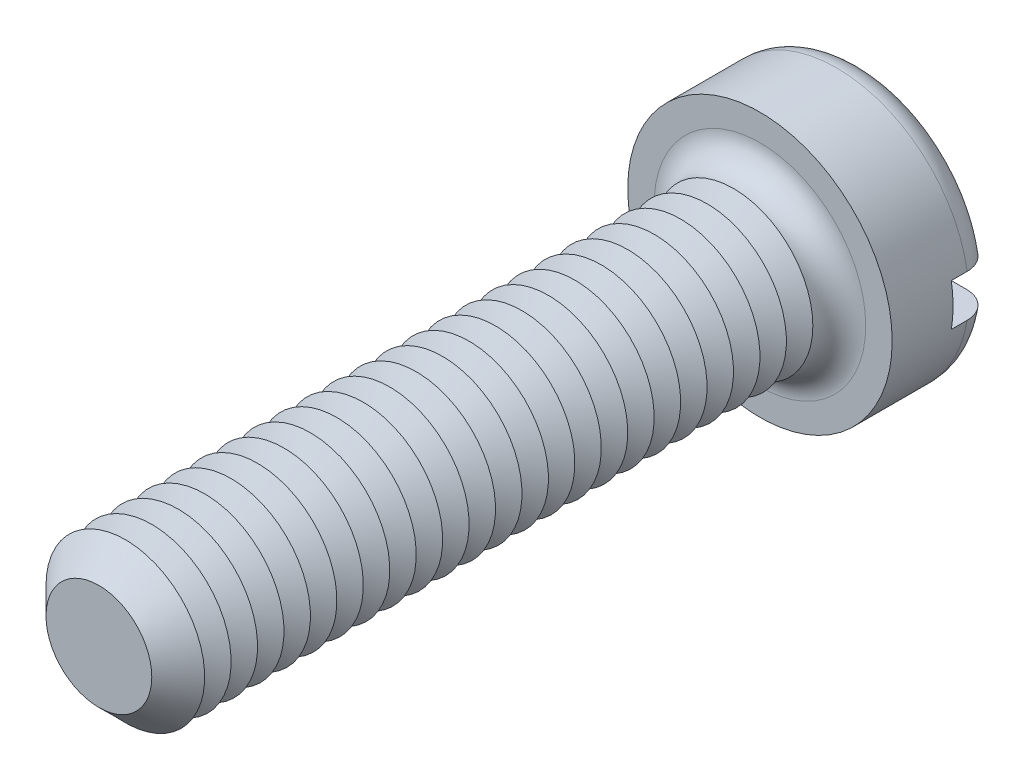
ISO-10303-21;
HEADER;
FILE_DESCRIPTION(('STEP AP214'),'2;1');
FILE_NAME('part.step','',(''),(''),'','','');
FILE_SCHEMA(('AUTOMOTIVE_DESIGN { 1 0 10303 214 1 1 1 1 }'));
ENDSEC;
DATA;
#1=APPLICATION_CONTEXT('core data for automotive mechanical design processes');
#2=APPLICATION_PROTOCOL_DEFINITION('international standard','automotive_design',2000,#1);
#3=PRODUCT_CONTEXT('',#1,'mechanical');
#4=PRODUCT('Part','Part','',(#3));
#5=PRODUCT_RELATED_PRODUCT_CATEGORY('part','',(#4));
#6=PRODUCT_DEFINITION_FORMATION('','',#4);
#7=PRODUCT_DEFINITION_CONTEXT('part definition',#1,'design');
#8=PRODUCT_DEFINITION('design','',#6,#7);
#9=PRODUCT_DEFINITION_SHAPE('','',#8);
#10=(LENGTH_UNIT() NAMED_UNIT(*) SI_UNIT(.MILLI.,.METRE.));
#11=(NAMED_UNIT(*) PLANE_ANGLE_UNIT() SI_UNIT($,.RADIAN.));
#12=(NAMED_UNIT(*) SI_UNIT($,.STERADIAN.) SOLID_ANGLE_UNIT());
#13=UNCERTAINTY_MEASURE_WITH_UNIT(LENGTH_MEASURE(1.E-05),#10,'distance_accuracy_value','');
#14=(GEOMETRIC_REPRESENTATION_CONTEXT(3) GLOBAL_UNCERTAINTY_ASSIGNED_CONTEXT((#13)) GLOBAL_UNIT_ASSIGNED_CONTEXT((#10,
#11,#12)) REPRESENTATION_CONTEXT('',''));
#15=CARTESIAN_POINT('',(0.,0.,0.));
#16=DIRECTION('',(0.,0.,1.));
#17=DIRECTION('',(1.,0.,0.));
#18=AXIS2_PLACEMENT_3D('',#15,#16,#17);
#19=CARTESIAN_POINT('',(0.,0.,-3.9));
#20=DIRECTION('',(0.,0.,1.));
#21=DIRECTION('',(1.,0.,0.));
#22=AXIS2_PLACEMENT_3D('',#19,#20,#21);
#23=PLANE('',#22);
#24=CARTESIAN_POINT('',(0.,0.,-3.9));
#25=DIRECTION('',(0.,0.,1.));
#26=DIRECTION('',(1.,0.,0.));
#27=AXIS2_PLACEMENT_3D('',#24,#25,#26);
#28=CIRCLE('',#27,4.);
#29=CARTESIAN_POINT('',(-3.91918358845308,0.800000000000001,-3.9));
#30=VERTEX_POINT('',#29);
#31=CARTESIAN_POINT('',(3.91918358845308,0.8,-3.9));
#32=VERTEX_POINT('',#31);
#33=EDGE_CURVE('E116',#30,#32,#28,.F.);
#34=ORIENTED_EDGE('',*,*,#33,.T.);
#35=DIRECTION('',(1.,0.,0.));
#36=VECTOR('',#35,1.);
#37=CARTESIAN_POINT('',(-5.,0.800000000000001,-3.9));
#38=LINE('',#37,#36);
#39=EDGE_CURVE('E111',#30,#32,#38,.T.);
#40=ORIENTED_EDGE('',*,*,#39,.F.);
#41=EDGE_LOOP('',(#34,#40));
#42=FACE_BOUND('',#41,.T.);
#43=ADVANCED_FACE('F39',(#42),#23,.F.);
#44=CARTESIAN_POINT('',(0.,0.,-2.9));
#45=DIRECTION('',(0.,0.,1.));
#46=DIRECTION('',(1.,0.,0.));
#47=AXIS2_PLACEMENT_3D('',#44,#45,#46);
#48=TOROIDAL_SURFACE('',#47,4.,1.);
#49=CARTESIAN_POINT('',(-4.76648512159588,0.800000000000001,-3.45304061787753));
#50=CARTESIAN_POINT('',(-4.73486405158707,0.800000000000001,-3.50001565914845));
#51=CARTESIAN_POINT('',(-4.69920787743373,0.800000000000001,-3.54432871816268));
#52=CARTESIAN_POINT('',(-4.62090302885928,0.800000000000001,-3.62634638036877));
#53=CARTESIAN_POINT('',(-4.57824494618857,0.800000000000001,-3.66404194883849));
#54=CARTESIAN_POINT('',(-4.48726975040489,0.800000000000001,-3.73172278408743));
#55=CARTESIAN_POINT('',(-4.43895902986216,0.800000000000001,-3.76171664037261));
#56=CARTESIAN_POINT('',(-4.33804923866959,0.800000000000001,-3.81326437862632));
#57=CARTESIAN_POINT('',(-4.2854512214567,0.800000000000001,-3.8348203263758));
#58=CARTESIAN_POINT('',(-4.17679895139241,0.800000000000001,-3.86918431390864));
#59=CARTESIAN_POINT('',(-4.12071163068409,0.800000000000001,-3.88188775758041));
#60=CARTESIAN_POINT('',(-4.00720729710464,0.800000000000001,-3.89785932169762));
#61=CARTESIAN_POINT('',(-3.94979011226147,0.800000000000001,-3.9011262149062));
#62=CARTESIAN_POINT('',(-3.83429042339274,0.800000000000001,-3.89816676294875));
#63=CARTESIAN_POINT('',(-3.77621176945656,0.800000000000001,-3.89178937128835));
#64=CARTESIAN_POINT('',(-3.66191938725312,0.800000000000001,-3.8694726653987));
#65=CARTESIAN_POINT('',(-3.60570580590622,0.800000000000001,-3.85353259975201));
#66=CARTESIAN_POINT('',(-3.49618749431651,0.800000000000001,-3.81233202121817));
#67=CARTESIAN_POINT('',(-3.44291561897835,0.800000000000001,-3.78698406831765));
#68=CARTESIAN_POINT('',(-3.34140774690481,0.800000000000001,-3.72766098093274));
#69=CARTESIAN_POINT('',(-3.29317182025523,0.800000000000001,-3.69368572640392));
#70=CARTESIAN_POINT('',(-3.20343355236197,0.800000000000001,-3.6182054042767));
#71=CARTESIAN_POINT('',(-3.16189680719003,0.800000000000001,-3.57674128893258));
#72=CARTESIAN_POINT('',(-3.08658236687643,0.800000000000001,-3.48727547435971));
#73=CARTESIAN_POINT('',(-3.05280364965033,0.800000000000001,-3.43927463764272));
#74=CARTESIAN_POINT('',(-2.99489532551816,0.800000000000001,-3.33932895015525));
#75=CARTESIAN_POINT('',(-2.97055012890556,0.800000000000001,-3.28750911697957));
#76=CARTESIAN_POINT('',(-2.93124252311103,0.800000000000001,-3.18042600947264));
#77=CARTESIAN_POINT('',(-2.91627793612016,0.800000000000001,-3.12516353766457));
#78=CARTESIAN_POINT('',(-2.89663075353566,0.800000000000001,-3.01470560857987));
#79=CARTESIAN_POINT('',(-2.89162828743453,0.800000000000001,-2.95956691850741));
#80=CARTESIAN_POINT('',(-2.89112479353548,0.800000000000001,-2.84924961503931));
#81=CARTESIAN_POINT('',(-2.89562264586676,0.800000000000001,-2.79407100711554));
#82=CARTESIAN_POINT('',(-2.91379565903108,0.800000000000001,-2.6861912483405));
#83=CARTESIAN_POINT('',(-2.92731815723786,0.800000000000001,-2.63346424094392));
#84=CARTESIAN_POINT('',(-2.96290888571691,0.800000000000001,-2.53098203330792));
#85=CARTESIAN_POINT('',(-2.98497757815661,0.800000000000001,-2.48122699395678));
#86=CARTESIAN_POINT('',(-3.03728055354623,0.800000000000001,-2.38535286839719));
#87=CARTESIAN_POINT('',(-3.06761989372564,0.800000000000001,-2.33929117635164));
#88=CARTESIAN_POINT('',(-3.13537950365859,0.800000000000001,-2.2527125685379));
#89=CARTESIAN_POINT('',(-3.17280082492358,0.800000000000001,-2.21219647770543));
#90=CARTESIAN_POINT('',(-3.2549164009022,0.800000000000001,-2.13651195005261));
#91=CARTESIAN_POINT('',(-3.29980186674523,0.800000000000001,-2.10155095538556));
#92=CARTESIAN_POINT('',(-3.39467666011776,0.800000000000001,-2.03942270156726));
#93=CARTESIAN_POINT('',(-3.44466673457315,0.800000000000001,-2.01225658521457));
#94=CARTESIAN_POINT('',(-3.5497933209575,0.800000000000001,-1.96576935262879));
#95=CARTESIAN_POINT('',(-3.60503228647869,0.800000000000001,-1.94667963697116));
#96=CARTESIAN_POINT('',(-3.71791613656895,0.800000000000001,-1.91794308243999));
#97=CARTESIAN_POINT('',(-3.77556119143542,0.800000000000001,-1.90829691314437));
#98=CARTESIAN_POINT('',(-3.89221522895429,0.800000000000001,-1.89869331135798));
#99=CARTESIAN_POINT('',(-3.9512319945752,0.800000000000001,-1.89882985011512));
#100=CARTESIAN_POINT('',(-4.06839541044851,0.800000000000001,-1.90907818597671));
#101=CARTESIAN_POINT('',(-4.12654207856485,0.800000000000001,-1.91918977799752));
#102=CARTESIAN_POINT('',(-4.23988103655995,0.800000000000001,-1.9490667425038));
#103=CARTESIAN_POINT('',(-4.29509069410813,0.800000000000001,-1.96876615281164));
#104=CARTESIAN_POINT('',(-4.40134194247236,0.800000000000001,-2.01729572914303));
#105=CARTESIAN_POINT('',(-4.45238383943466,0.800000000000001,-2.04612522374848));
#106=CARTESIAN_POINT('',(-4.54801343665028,0.800000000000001,-2.1116316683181));
#107=CARTESIAN_POINT('',(-4.59268768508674,0.800000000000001,-2.14818225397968));
#108=CARTESIAN_POINT('',(-4.67513924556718,0.800000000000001,-2.22837632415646));
#109=CARTESIAN_POINT('',(-4.71291715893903,0.800000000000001,-2.27201918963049));
#110=CARTESIAN_POINT('',(-4.77986554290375,0.800000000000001,-2.36439990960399));
#111=CARTESIAN_POINT('',(-4.80916462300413,0.800000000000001,-2.41304457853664));
#112=CARTESIAN_POINT('',(-4.85906149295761,0.800000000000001,-2.51460659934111));
#113=CARTESIAN_POINT('',(-4.8796602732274,0.800000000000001,-2.56752346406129));
#114=CARTESIAN_POINT('',(-4.9113264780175,0.800000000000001,-2.67542592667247));
#115=CARTESIAN_POINT('',(-4.92250819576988,0.800000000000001,-2.73037800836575));
#116=CARTESIAN_POINT('',(-4.93542682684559,0.800000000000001,-2.84139649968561));
#117=CARTESIAN_POINT('',(-4.93716171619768,0.800000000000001,-2.89746314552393));
#118=CARTESIAN_POINT('',(-4.93114851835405,0.800000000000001,-3.00876455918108));
#119=CARTESIAN_POINT('',(-4.92345325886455,0.800000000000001,-3.0640022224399));
#120=CARTESIAN_POINT('',(-4.8989032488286,0.800000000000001,-3.17235240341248));
#121=CARTESIAN_POINT('',(-4.88205998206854,0.800000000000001,-3.22546749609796));
#122=CARTESIAN_POINT('',(-4.84819200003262,0.800000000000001,-3.30764066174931));
#123=CARTESIAN_POINT('',(-4.83390853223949,0.800000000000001,-3.33785845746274));
#124=CARTESIAN_POINT('',(-4.80237957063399,0.800000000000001,-3.39670633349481));
#125=CARTESIAN_POINT('',(-4.78513409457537,0.800000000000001,-3.42533642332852));
#126=CARTESIAN_POINT('',(-4.76648512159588,0.800000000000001,-3.45304061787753));
#127=B_SPLINE_CURVE_WITH_KNOTS('',3,(#49,#50,#51,#52,#53,#54,#55,#56,#57,#58,#59,#60,#61,#62,
#63,#64,#65,#66,#67,#68,#69,#70,#71,#72,#73,#74,#75,#76,#77,#78,#79,#80,#81,#82,#83,#84,#85,#86,
#87,#88,#89,#90,#91,#92,#93,#94,#95,#96,#97,#98,#99,#100,#101,#102,#103,#104,#105,#106,#107,
#108,#109,#110,#111,#112,#113,#114,#115,#116,#117,#118,#119,#120,#121,#122,#123,#124,#125,#126),
.UNSPECIFIED.,.T.,.F.,(4,2,2,2,2,2,2,2,2,2,2,2,2,2,2,2,2,2,2,2,2,2,2,2,2,2,2,2,2,2,2,2,2,2,2,2,
2,2,4),(0.,0.169755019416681,0.339740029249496,0.509534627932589,0.67928763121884,
0.851013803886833,1.02276230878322,1.19722869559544,1.37170879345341,1.54785292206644,
1.72399950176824,1.89921049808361,2.07439839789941,2.24530597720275,2.41617386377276,
2.58146078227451,2.74672821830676,2.90926852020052,3.0718176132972,3.2365363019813,
3.40127946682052,3.57118676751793,3.74111896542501,3.91563534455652,4.09016409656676,
4.26636956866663,4.4425714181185,4.61757781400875,4.79257134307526,4.96489650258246,
5.13720662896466,5.30674670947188,5.47626748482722,5.64369988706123,5.81116816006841,
5.97770254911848,6.14402836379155,6.24414438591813,6.34425980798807),.UNSPECIFIED.);
#128=CARTESIAN_POINT('',(-4.93558507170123,0.800000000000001,-2.9));
#129=VERTEX_POINT('',#128);
#130=EDGE_CURVE('E363',#129,#30,#127,.T.);
#131=ORIENTED_EDGE('',*,*,#130,.F.);
#132=CARTESIAN_POINT('',(0.,0.,-2.9));
#133=DIRECTION('',(0.,0.,1.));
#134=DIRECTION('',(1.,0.,0.));
#135=AXIS2_PLACEMENT_3D('',#132,#133,#134);
#136=CIRCLE('',#135,5.);
#137=CARTESIAN_POINT('',(4.93558507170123,0.8,-2.9));
#138=VERTEX_POINT('',#137);
#139=EDGE_CURVE('E125',#138,#129,#136,.T.);
#140=ORIENTED_EDGE('',*,*,#139,.F.);
#141=CARTESIAN_POINT('',(2.98553785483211,0.8,-3.31649797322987));
#142=CARTESIAN_POINT('',(3.00991125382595,0.8,-3.36788093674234));
#143=CARTESIAN_POINT('',(3.03875556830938,0.8,-3.41719756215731));
#144=CARTESIAN_POINT('',(3.1043993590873,0.8,-3.51028676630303));
#145=CARTESIAN_POINT('',(3.1412115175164,0.8,-3.55405032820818));
#146=CARTESIAN_POINT('',(3.22153641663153,0.8,-3.63476402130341));
#147=CARTESIAN_POINT('',(3.26503706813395,0.8,-3.67172618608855));
#148=CARTESIAN_POINT('',(3.35749627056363,0.8,-3.73799476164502));
#149=CARTESIAN_POINT('',(3.4064533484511,0.8,-3.76730323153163));
#150=CARTESIAN_POINT('',(3.5095773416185,0.8,-3.81809642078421));
#151=CARTESIAN_POINT('',(3.56383317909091,0.8,-3.83940072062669));
#152=CARTESIAN_POINT('',(3.67513017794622,0.8,-3.87272481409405));
#153=CARTESIAN_POINT('',(3.7321717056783,0.8,-3.88474338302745));
#154=CARTESIAN_POINT('',(3.84815688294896,0.8,-3.89923413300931));
#155=CARTESIAN_POINT('',(3.90711516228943,0.8,-3.9015896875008));
#156=CARTESIAN_POINT('',(4.02458610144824,0.8,-3.89631753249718));
#157=CARTESIAN_POINT('',(4.08309876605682,0.8,-3.8886899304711));
#158=CARTESIAN_POINT('',(4.19768646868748,0.8,-3.86366584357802));
#159=CARTESIAN_POINT('',(4.25377243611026,0.8,-3.84631948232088));
#160=CARTESIAN_POINT('',(4.3621676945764,0.8,-3.80231797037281));
#161=CARTESIAN_POINT('',(4.41447726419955,0.8,-3.77566350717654));
#162=CARTESIAN_POINT('',(4.51300872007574,0.8,-3.71421163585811));
#163=CARTESIAN_POINT('',(4.5593085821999,0.8,-3.67953927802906));
#164=CARTESIAN_POINT('',(4.64530675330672,0.8,-3.60279495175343));
#165=CARTESIAN_POINT('',(4.68500564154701,0.8,-3.56072363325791));
#166=CARTESIAN_POINT('',(4.75599202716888,0.8,-3.47111750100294));
#167=CARTESIAN_POINT('',(4.7874061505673,0.8,-3.42368298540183));
#168=CARTESIAN_POINT('',(4.84170328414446,0.8,-3.32415927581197));
#169=CARTESIAN_POINT('',(4.86458695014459,0.8,-3.2720704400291));
#170=CARTESIAN_POINT('',(4.90088120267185,0.8,-3.16544016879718));
#171=CARTESIAN_POINT('',(4.91440984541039,0.8,-3.11093889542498));
#172=CARTESIAN_POINT('',(4.93205429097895,0.8,-3.00043391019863));
#173=CARTESIAN_POINT('',(4.93617053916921,0.8,-2.9444302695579));
#174=CARTESIAN_POINT('',(4.93486973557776,0.8,-2.83292218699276));
#175=CARTESIAN_POINT('',(4.92951827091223,0.8,-2.77741696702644));
#176=CARTESIAN_POINT('',(4.90957104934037,0.8,-2.66809456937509));
#177=CARTESIAN_POINT('',(4.89497541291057,0.8,-2.61427736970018));
#178=CARTESIAN_POINT('',(4.85697876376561,0.8,-2.50985095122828));
#179=CARTESIAN_POINT('',(4.83357805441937,0.8,-2.45924162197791));
#180=CARTESIAN_POINT('',(4.77866660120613,0.8,-2.36263484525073));
#181=CARTESIAN_POINT('',(4.74715567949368,0.8,-2.31663749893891));
#182=CARTESIAN_POINT('',(4.67670791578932,0.8,-2.23021464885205));
#183=CARTESIAN_POINT('',(4.6377224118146,0.8,-2.1898288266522));
#184=CARTESIAN_POINT('',(4.55359880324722,0.8,-2.11607828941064));
#185=CARTESIAN_POINT('',(4.50846036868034,0.8,-2.08271395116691));
#186=CARTESIAN_POINT('',(4.41271544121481,0.8,-2.02349513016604));
#187=CARTESIAN_POINT('',(4.36204749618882,0.8,-1.99774003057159));
#188=CARTESIAN_POINT('',(4.257155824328,0.8,-1.95495040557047));
#189=CARTESIAN_POINT('',(4.20293181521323,0.8,-1.93791657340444));
#190=CARTESIAN_POINT('',(4.09154156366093,0.8,-1.91276335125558));
#191=CARTESIAN_POINT('',(4.03434212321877,0.8,-1.90479098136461));
#192=CARTESIAN_POINT('',(3.91941228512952,0.8,-1.89840884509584));
#193=CARTESIAN_POINT('',(3.8616818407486,0.8,-1.89999992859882));
#194=CARTESIAN_POINT('',(3.7464111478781,0.8,-1.91275144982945));
#195=CARTESIAN_POINT('',(3.6888866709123,0.8,-1.92405471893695));
#196=CARTESIAN_POINT('',(3.57652290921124,0.8,-1.95609086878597));
#197=CARTESIAN_POINT('',(3.52168382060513,0.8,-1.97682443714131));
#198=CARTESIAN_POINT('',(3.41589179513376,0.8,-2.02733294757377));
#199=CARTESIAN_POINT('',(3.36496676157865,0.8,-2.05716640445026));
#200=CARTESIAN_POINT('',(3.26890903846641,0.8,-2.12504079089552));
#201=CARTESIAN_POINT('',(3.22377627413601,0.8,-2.16308161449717));
#202=CARTESIAN_POINT('',(3.141135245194,0.8,-2.24593284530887));
#203=CARTESIAN_POINT('',(3.1035541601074,0.8,-2.29067053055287));
#204=CARTESIAN_POINT('',(3.03669700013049,0.8,-2.38597317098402));
#205=CARTESIAN_POINT('',(3.00741914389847,0.8,-2.43653687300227));
#206=CARTESIAN_POINT('',(2.95891799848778,0.8,-2.54052959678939));
#207=CARTESIAN_POINT('',(2.93943249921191,0.8,-2.59383627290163));
#208=CARTESIAN_POINT('',(2.9100081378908,0.8,-2.70303736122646));
#209=CARTESIAN_POINT('',(2.90006970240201,0.8,-2.75893188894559));
#210=CARTESIAN_POINT('',(2.89027863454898,0.8,-2.86986958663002));
#211=CARTESIAN_POINT('',(2.89012791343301,0.8,-2.92488680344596));
#212=CARTESIAN_POINT('',(2.89917145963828,0.8,-3.03409648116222));
#213=CARTESIAN_POINT('',(2.90835313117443,0.8,-3.08828995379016));
#214=CARTESIAN_POINT('',(2.92977618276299,0.8,-3.17141652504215));
#215=CARTESIAN_POINT('',(2.93899011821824,0.8,-3.20116372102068));
#216=CARTESIAN_POINT('',(2.96020249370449,0.8,-3.25964614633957));
#217=CARTESIAN_POINT('',(2.97220082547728,0.8,-3.28838141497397));
#218=CARTESIAN_POINT('',(2.98553785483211,0.8,-3.31649797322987));
#219=B_SPLINE_CURVE_WITH_KNOTS('',3,(#141,#142,#143,#144,#145,#146,#147,#148,#149,#150,#151,
#152,#153,#154,#155,#156,#157,#158,#159,#160,#161,#162,#163,#164,#165,#166,#167,#168,#169,#170,
#171,#172,#173,#174,#175,#176,#177,#178,#179,#180,#181,#182,#183,#184,#185,#186,#187,#188,#189,
#190,#191,#192,#193,#194,#195,#196,#197,#198,#199,#200,#201,#202,#203,#204,#205,#206,#207,#208,
#209,#210,#211,#212,#213,#214,#215,#216,#217,#218),.UNSPECIFIED.,.T.,.F.,(4,2,2,2,2,2,2,2,2,2,2,
2,2,2,2,2,2,2,2,2,2,2,2,2,2,2,2,2,2,2,2,2,2,2,2,2,2,2,4),(0.,0.170493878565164,
0.341261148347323,0.511723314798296,0.682139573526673,0.856194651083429,1.03027268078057,
1.20644565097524,1.38261672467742,1.55788746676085,1.73314526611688,1.90583484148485,
2.07850925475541,2.24836742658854,2.41821253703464,2.58587311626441,2.75352576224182,
2.92002154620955,3.08651516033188,3.25300303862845,3.41949456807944,3.58710926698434,
3.75473295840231,3.92445790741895,4.09419634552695,4.26665110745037,4.43912119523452,
4.61417197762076,4.78923552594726,4.96544940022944,5.1416609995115,5.31608191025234,
5.49046537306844,5.65989063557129,5.82932346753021,5.99359365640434,6.157642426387,
6.250939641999,6.34423323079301),.UNSPECIFIED.);
#220=EDGE_CURVE('E365',#32,#138,#219,.T.);
#221=ORIENTED_EDGE('',*,*,#220,.F.);
#222=ORIENTED_EDGE('',*,*,#33,.F.);
#223=EDGE_LOOP('',(#131,#140,#221,#222));
#224=FACE_BOUND('',#223,.T.);
#225=ADVANCED_FACE('F347',(#224),#48,.T.);
#226=CARTESIAN_POINT('',(0.,0.,-3.9));
#227=DIRECTION('',(0.,0.,1.));
#228=DIRECTION('',(1.,0.,0.));
#229=AXIS2_PLACEMENT_3D('',#226,#227,#228);
#230=CYLINDRICAL_SURFACE('',#229,5.);
#231=DIRECTION('',(0.,0.,1.));
#232=VECTOR('',#231,1.);
#233=CARTESIAN_POINT('',(4.93558507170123,0.8,-3.9));
#234=LINE('',#233,#232);
#235=CARTESIAN_POINT('',(4.93558507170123,0.8,-2.3));
#236=VERTEX_POINT('',#235);
#237=EDGE_CURVE('E379',#138,#236,#234,.T.);
#238=ORIENTED_EDGE('',*,*,#237,.F.);
#239=ORIENTED_EDGE('',*,*,#139,.T.);
#240=DIRECTION('',(0.,0.,1.));
#241=VECTOR('',#240,1.);
#242=CARTESIAN_POINT('',(-4.93558507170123,0.800000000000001,-3.9));
#243=LINE('',#242,#241);
#244=CARTESIAN_POINT('',(-4.93558507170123,0.800000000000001,-2.3));
#245=VERTEX_POINT('',#244);
#246=EDGE_CURVE('E63',#245,#129,#243,.F.);
#247=ORIENTED_EDGE('',*,*,#246,.F.);
#248=CARTESIAN_POINT('',(0.,0.,-2.3));
#249=DIRECTION('',(0.,0.,-1.));
#250=DIRECTION('',(-1.,0.,0.));
#251=AXIS2_PLACEMENT_3D('',#248,#249,#250);
#252=CIRCLE('',#251,5.);
#253=CARTESIAN_POINT('',(-4.93558507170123,-0.799999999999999,-2.3));
#254=VERTEX_POINT('',#253);
#255=EDGE_CURVE('E43',#245,#254,#252,.F.);
#256=ORIENTED_EDGE('',*,*,#255,.T.);
#257=DIRECTION('',(0.,0.,1.));
#258=VECTOR('',#257,1.);
#259=CARTESIAN_POINT('',(-4.93558507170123,-0.799999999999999,-3.9));
#260=LINE('',#259,#258);
#261=CARTESIAN_POINT('',(-4.93558507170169,-0.799999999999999,-2.89999999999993));
#262=VERTEX_POINT('',#261);
#263=EDGE_CURVE('E377',#262,#254,#260,.T.);
#264=ORIENTED_EDGE('',*,*,#263,.F.);
#265=CARTESIAN_POINT('',(4.93558507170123,-0.8,-2.9));
#266=VERTEX_POINT('',#265);
#267=EDGE_CURVE('E127',#262,#266,#136,.T.);
#268=ORIENTED_EDGE('',*,*,#267,.T.);
#269=DIRECTION('',(0.,0.,1.));
#270=VECTOR('',#269,1.);
#271=CARTESIAN_POINT('',(4.93558507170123,-0.8,-3.9));
#272=LINE('',#271,#270);
#273=CARTESIAN_POINT('',(4.93558507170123,-0.8,-2.3));
#274=VERTEX_POINT('',#273);
#275=EDGE_CURVE('E55',#274,#266,#272,.F.);
#276=ORIENTED_EDGE('',*,*,#275,.F.);
#277=EDGE_CURVE('E11',#274,#236,#252,.F.);
#278=ORIENTED_EDGE('',*,*,#277,.T.);
#279=EDGE_LOOP('',(#238,#239,#247,#256,#264,#268,#276,#278));
#280=FACE_BOUND('',#279,.T.);
#281=CARTESIAN_POINT('',(0.,0.,0.));
#282=DIRECTION('',(0.,0.,1.));
#283=DIRECTION('',(1.,0.,0.));
#284=AXIS2_PLACEMENT_3D('',#281,#282,#283);
#285=CIRCLE('',#284,5.);
#286=CARTESIAN_POINT('',(5.,0.,0.));
#287=VERTEX_POINT('',#286);
#288=EDGE_CURVE('E382',#287,#287,#285,.T.);
#289=ORIENTED_EDGE('',*,*,#288,.F.);
#290=EDGE_LOOP('',(#289));
#291=FACE_BOUND('',#290,.T.);
#292=ADVANCED_FACE('F343',(#280,#291),#230,.T.);
#293=CARTESIAN_POINT('',(3.91918358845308,-0.8,-3.9));
#294=VERTEX_POINT('',#293);
#295=CARTESIAN_POINT('',(-3.91918358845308,-0.799999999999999,-3.9));
#296=VERTEX_POINT('',#295);
#297=EDGE_CURVE('E109',#294,#296,#28,.F.);
#298=ORIENTED_EDGE('',*,*,#297,.T.);
#299=DIRECTION('',(-1.,0.,0.));
#300=VECTOR('',#299,1.);
#301=CARTESIAN_POINT('',(-5.,-0.799999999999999,-3.9));
#302=LINE('',#301,#300);
#303=EDGE_CURVE('E96',#294,#296,#302,.T.);
#304=ORIENTED_EDGE('',*,*,#303,.F.);
#305=EDGE_LOOP('',(#298,#304));
#306=FACE_BOUND('',#305,.T.);
#307=ADVANCED_FACE('F108',(#306),#23,.F.);
#308=CARTESIAN_POINT('',(0.,0.,0.));
#309=DIRECTION('',(0.,0.,1.));
#310=DIRECTION('',(1.,0.,0.));
#311=AXIS2_PLACEMENT_3D('',#308,#309,#310);
#312=PLANE('',#311);
#313=CARTESIAN_POINT('',(0.,0.,0.));
#314=DIRECTION('',(0.,0.,1.));
#315=DIRECTION('',(1.,0.,0.));
#316=AXIS2_PLACEMENT_3D('',#313,#314,#315);
#317=CIRCLE('',#316,4.);
#318=CARTESIAN_POINT('',(4.,0.,0.));
#319=VERTEX_POINT('',#318);
#320=EDGE_CURVE('E115',#319,#319,#317,.F.);
#321=ORIENTED_EDGE('',*,*,#320,.T.);
#322=EDGE_LOOP('',(#321));
#323=FACE_BOUND('',#322,.T.);
#324=ORIENTED_EDGE('',*,*,#288,.T.);
#325=EDGE_LOOP('',(#324));
#326=FACE_BOUND('',#325,.T.);
#327=ADVANCED_FACE('F342',(#323,#326),#312,.T.);
#328=CARTESIAN_POINT('',(-4.76648512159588,-0.799999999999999,-3.45304061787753));
#329=CARTESIAN_POINT('',(-4.7975694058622,-0.799999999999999,-3.40685392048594));
#330=CARTESIAN_POINT('',(-4.82479903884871,-0.799999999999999,-3.35802740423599));
#331=CARTESIAN_POINT('',(-4.87070632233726,-0.799999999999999,-3.25646127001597));
#332=CARTESIAN_POINT('',(-4.8893747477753,-0.799999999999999,-3.20371750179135));
#333=CARTESIAN_POINT('',(-4.91756720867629,-0.799999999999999,-3.09584501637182));
#334=CARTESIAN_POINT('',(-4.92709302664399,-0.799999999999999,-3.04071676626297));
#335=CARTESIAN_POINT('',(-4.93671217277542,-0.799999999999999,-2.92965669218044));
#336=CARTESIAN_POINT('',(-4.93680767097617,-0.799999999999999,-2.87372505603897));
#337=CARTESIAN_POINT('',(-4.92758675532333,-0.799999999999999,-2.76284675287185));
#338=CARTESIAN_POINT('',(-4.91830421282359,-0.799999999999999,-2.70789726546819));
#339=CARTESIAN_POINT('',(-4.89065741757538,-0.799999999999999,-2.60033228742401));
#340=CARTESIAN_POINT('',(-4.87229291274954,-0.799999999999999,-2.54771686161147));
#341=CARTESIAN_POINT('',(-4.82699855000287,-0.799999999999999,-2.44622441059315));
#342=CARTESIAN_POINT('',(-4.80005659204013,-0.799999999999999,-2.39735278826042));
#343=CARTESIAN_POINT('',(-4.73841244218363,-0.799999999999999,-2.30477947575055));
#344=CARTESIAN_POINT('',(-4.70371003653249,-0.799999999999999,-2.26107792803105));
#345=CARTESIAN_POINT('',(-4.62724516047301,-0.799999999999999,-2.17969334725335));
#346=CARTESIAN_POINT('',(-4.58542787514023,-0.799999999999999,-2.14206183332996));
#347=CARTESIAN_POINT('',(-4.49614171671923,-0.799999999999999,-2.07424284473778));
#348=CARTESIAN_POINT('',(-4.44867251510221,-0.799999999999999,-2.04405580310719));
#349=CARTESIAN_POINT('',(-4.34875035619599,-0.799999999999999,-1.99153688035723));
#350=CARTESIAN_POINT('',(-4.29623870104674,-0.799999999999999,-1.96931670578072));
#351=CARTESIAN_POINT('',(-4.18826905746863,-0.799999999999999,-1.93384994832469));
#352=CARTESIAN_POINT('',(-4.1328108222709,-0.799999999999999,-1.92060411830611));
#353=CARTESIAN_POINT('',(-4.01956054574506,-0.799999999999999,-1.90323798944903));
#354=CARTESIAN_POINT('',(-3.96174522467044,-0.799999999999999,-1.89926947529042));
#355=CARTESIAN_POINT('',(-3.84625419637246,-0.799999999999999,-1.90095183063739));
#356=CARTESIAN_POINT('',(-3.78857850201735,-0.799999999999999,-1.90660355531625));
#357=CARTESIAN_POINT('',(-3.67415602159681,-0.799999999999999,-1.92748272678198));
#358=CARTESIAN_POINT('',(-3.61743328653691,-0.799999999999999,-1.94284216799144));
#359=CARTESIAN_POINT('',(-3.50734962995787,-0.799999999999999,-1.9828275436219));
#360=CARTESIAN_POINT('',(-3.4539889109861,-0.799999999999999,-2.00745403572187));
#361=CARTESIAN_POINT('',(-3.35197118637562,-0.799999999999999,-2.06542964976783));
#362=CARTESIAN_POINT('',(-3.30333217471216,-0.799999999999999,-2.0988104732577));
#363=CARTESIAN_POINT('',(-3.21244692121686,-0.799999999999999,-2.17337326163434));
#364=CARTESIAN_POINT('',(-3.17020039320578,-0.799999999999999,-2.21455487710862));
#365=CARTESIAN_POINT('',(-3.0940098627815,-0.799999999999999,-2.30296695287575));
#366=CARTESIAN_POINT('',(-3.05995540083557,-0.799999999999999,-2.35010211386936));
#367=CARTESIAN_POINT('',(-3.00053815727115,-0.799999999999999,-2.4495670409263));
#368=CARTESIAN_POINT('',(-2.97517362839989,-0.799999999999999,-2.50189576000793));
#369=CARTESIAN_POINT('',(-2.93470320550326,-0.799999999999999,-2.60853979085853));
#370=CARTESIAN_POINT('',(-2.91930557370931,-0.799999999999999,-2.66274437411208));
#371=CARTESIAN_POINT('',(-2.89812734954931,-0.799999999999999,-2.77299836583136));
#372=CARTESIAN_POINT('',(-2.89234481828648,-0.799999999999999,-2.82904740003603));
#373=CARTESIAN_POINT('',(-2.89064073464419,-0.799999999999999,-2.93970612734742));
#374=CARTESIAN_POINT('',(-2.89444549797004,-0.799999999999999,-2.99431180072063));
#375=CARTESIAN_POINT('',(-2.9112006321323,-0.799999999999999,-3.10209766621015));
#376=CARTESIAN_POINT('',(-2.9241507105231,-0.799999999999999,-3.1552779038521));
#377=CARTESIAN_POINT('',(-2.95868580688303,-0.799999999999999,-3.25858631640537));
#378=CARTESIAN_POINT('',(-2.98024709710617,-0.799999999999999,-3.30872244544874));
#379=CARTESIAN_POINT('',(-3.03128544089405,-0.799999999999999,-3.40478519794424));
#380=CARTESIAN_POINT('',(-3.06076335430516,-0.799999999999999,-3.45071136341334));
#381=CARTESIAN_POINT('',(-3.12753448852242,-0.799999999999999,-3.53826932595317));
#382=CARTESIAN_POINT('',(-3.16500083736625,-0.799999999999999,-3.57976901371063));
#383=CARTESIAN_POINT('',(-3.24617503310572,-0.799999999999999,-3.65613204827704));
#384=CARTESIAN_POINT('',(-3.28988388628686,-0.799999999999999,-3.69099432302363));
#385=CARTESIAN_POINT('',(-3.38380639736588,-0.799999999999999,-3.75424083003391));
#386=CARTESIAN_POINT('',(-3.43418287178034,-0.799999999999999,-3.78238342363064));
#387=CARTESIAN_POINT('',(-3.53887888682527,-0.799999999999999,-3.83000231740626));
#388=CARTESIAN_POINT('',(-3.59319889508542,-0.799999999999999,-3.84947758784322));
#389=CARTESIAN_POINT('',(-3.70539237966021,-0.799999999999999,-3.87954336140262));
#390=CARTESIAN_POINT('',(-3.76331464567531,-0.799999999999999,-3.88995217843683));
#391=CARTESIAN_POINT('',(-3.88008461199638,-0.799999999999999,-3.9009132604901));
#392=CARTESIAN_POINT('',(-3.93893230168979,-0.799999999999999,-3.9014656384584));
#393=CARTESIAN_POINT('',(-4.05594892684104,-0.799999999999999,-3.89264187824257));
#394=CARTESIAN_POINT('',(-4.11411702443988,-0.799999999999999,-3.88325457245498));
#395=CARTESIAN_POINT('',(-4.22802928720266,-0.799999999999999,-3.85472582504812));
#396=CARTESIAN_POINT('',(-4.28377297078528,-0.799999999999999,-3.83558245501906));
#397=CARTESIAN_POINT('',(-4.39054463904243,-0.799999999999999,-3.78829842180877));
#398=CARTESIAN_POINT('',(-4.44161887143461,-0.799999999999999,-3.76026208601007));
#399=CARTESIAN_POINT('',(-4.53818016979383,-0.799999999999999,-3.69589278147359));
#400=CARTESIAN_POINT('',(-4.58367442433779,-0.799999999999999,-3.65957066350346));
#401=CARTESIAN_POINT('',(-4.65208830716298,-0.799999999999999,-3.59453310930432));
#402=CARTESIAN_POINT('',(-4.67711825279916,-0.799999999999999,-3.56800018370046));
#403=CARTESIAN_POINT('',(-4.72414423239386,-0.799999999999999,-3.51236863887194));
#404=CARTESIAN_POINT('',(-4.74614029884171,-0.799999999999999,-3.48327004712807));
#405=CARTESIAN_POINT('',(-4.76648512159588,-0.799999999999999,-3.45304061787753));
#406=B_SPLINE_CURVE_WITH_KNOTS('',3,(#328,#329,#330,#331,#332,#333,#334,#335,#336,#337,#338,
#339,#340,#341,#342,#343,#344,#345,#346,#347,#348,#349,#350,#351,#352,#353,#354,#355,#356,#357,
#358,#359,#360,#361,#362,#363,#364,#365,#366,#367,#368,#369,#370,#371,#372,#373,#374,#375,#376,
#377,#378,#379,#380,#381,#382,#383,#384,#385,#386,#387,#388,#389,#390,#391,#392,#393,#394,#395,
#396,#397,#398,#399,#400,#401,#402,#403,#404,#405),.UNSPECIFIED.,.T.,.F.,(4,2,2,2,2,2,2,2,2,2,2,
2,2,2,2,2,2,2,2,2,2,2,2,2,2,2,2,2,2,2,2,2,2,2,2,2,2,2,4),(0.,0.166886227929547,
0.333951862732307,0.500984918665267,0.667979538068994,0.834373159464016,1.00077139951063,
1.16740542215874,1.33404403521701,1.50202999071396,1.67002571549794,1.84029248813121,
2.01057354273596,2.18362161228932,2.35668506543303,2.53215380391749,2.70763310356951,
2.88375684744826,3.05987270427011,3.23346085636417,3.40701408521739,3.57522519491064,
3.74340238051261,3.90683338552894,4.0702591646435,4.23323770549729,4.39623395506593,
4.56320691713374,4.7302068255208,4.90252468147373,5.07486300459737,5.25058028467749,
5.42629555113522,5.60220844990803,5.77815613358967,5.95211162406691,6.12584060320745,
6.23506966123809,6.34429754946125),.UNSPECIFIED.);
#407=EDGE_CURVE('E103',#296,#262,#406,.T.);
#408=ORIENTED_EDGE('',*,*,#407,.F.);
#409=ORIENTED_EDGE('',*,*,#297,.F.);
#410=CARTESIAN_POINT('',(2.98553785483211,-0.8,-3.31649797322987));
#411=CARTESIAN_POINT('',(2.96216773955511,-0.8,-3.26721849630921));
#412=CARTESIAN_POINT('',(2.94287503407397,-0.8,-3.21596872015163));
#413=CARTESIAN_POINT('',(2.91313258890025,-0.8,-3.11092723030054));
#414=CARTESIAN_POINT('',(2.9026902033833,-0.8,-3.0571334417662));
#415=CARTESIAN_POINT('',(2.89104377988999,-0.8,-2.94853922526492));
#416=CARTESIAN_POINT('',(2.88984130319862,-0.8,-2.89373862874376));
#417=CARTESIAN_POINT('',(2.89672585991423,-0.8,-2.78473646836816));
#418=CARTESIAN_POINT('',(2.90481120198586,-0.8,-2.73053479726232));
#419=CARTESIAN_POINT('',(2.92989134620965,-0.8,-2.62460092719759));
#420=CARTESIAN_POINT('',(2.94682969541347,-0.8,-2.57285532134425));
#421=CARTESIAN_POINT('',(2.9889990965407,-0.8,-2.47286425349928));
#422=CARTESIAN_POINT('',(3.01423103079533,-0.8,-2.42461916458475));
#423=CARTESIAN_POINT('',(3.07271536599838,-0.8,-2.33201565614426));
#424=CARTESIAN_POINT('',(3.10610710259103,-0.8,-2.28774532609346));
#425=CARTESIAN_POINT('',(3.17963417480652,-0.8,-2.205215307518));
#426=CARTESIAN_POINT('',(3.21977054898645,-0.8,-2.16695654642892));
#427=CARTESIAN_POINT('',(3.3070361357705,-0.8,-2.09624274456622));
#428=CARTESIAN_POINT('',(3.35434874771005,-0.8,-2.06401396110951));
#429=CARTESIAN_POINT('',(3.45361131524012,-0.8,-2.00773436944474));
#430=CARTESIAN_POINT('',(3.50556189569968,-0.8,-1.98368466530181));
#431=CARTESIAN_POINT('',(3.61398433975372,-0.8,-1.94389460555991));
#432=CARTESIAN_POINT('',(3.67053506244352,-0.8,-1.92836880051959));
#433=CARTESIAN_POINT('',(3.78543606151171,-0.8,-1.90696594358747));
#434=CARTESIAN_POINT('',(3.84378643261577,-0.8,-1.90108940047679));
#435=CARTESIAN_POINT('',(3.96100201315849,-0.8,-1.89918115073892));
#436=CARTESIAN_POINT('',(4.01986821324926,-0.8,-1.90320860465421));
#437=CARTESIAN_POINT('',(4.13606891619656,-0.8,-1.9211820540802));
#438=CARTESIAN_POINT('',(4.19340347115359,-0.8,-1.93512771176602));
#439=CARTESIAN_POINT('',(4.30434213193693,-0.8,-1.97243705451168));
#440=CARTESIAN_POINT('',(4.35797549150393,-0.8,-1.99571368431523));
#441=CARTESIAN_POINT('',(4.46048254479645,-0.8,-2.0510826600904));
#442=CARTESIAN_POINT('',(4.50935662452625,-0.8,-2.08317429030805));
#443=CARTESIAN_POINT('',(4.60012348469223,-0.8,-2.15471647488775));
#444=CARTESIAN_POINT('',(4.64211506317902,-0.8,-2.19404167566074));
#445=CARTESIAN_POINT('',(4.71877054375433,-0.8,-2.27928299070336));
#446=CARTESIAN_POINT('',(4.75343508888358,-0.8,-2.32519852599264));
#447=CARTESIAN_POINT('',(4.81388799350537,-0.8,-2.4215411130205));
#448=CARTESIAN_POINT('',(4.83980652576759,-0.8,-2.47188650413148));
#449=CARTESIAN_POINT('',(4.88271402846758,-0.8,-2.57624865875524));
#450=CARTESIAN_POINT('',(4.89970360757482,-0.8,-2.63026517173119));
#451=CARTESIAN_POINT('',(4.92409334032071,-0.8,-2.73978844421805));
#452=CARTESIAN_POINT('',(4.93159814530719,-0.8,-2.79527191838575));
#453=CARTESIAN_POINT('',(4.93713723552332,-0.8,-2.90670881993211));
#454=CARTESIAN_POINT('',(4.9351718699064,-0.8,-2.9626622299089));
#455=CARTESIAN_POINT('',(4.92186293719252,-0.8,-3.07317093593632));
#456=CARTESIAN_POINT('',(4.91056393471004,-0.8,-3.12773160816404));
#457=CARTESIAN_POINT('',(4.87898532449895,-0.8,-3.234187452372));
#458=CARTESIAN_POINT('',(4.85870572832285,-0.8,-3.28608262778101));
#459=CARTESIAN_POINT('',(4.80971634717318,-0.8,-3.38586723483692));
#460=CARTESIAN_POINT('',(4.78098824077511,-0.8,-3.43374766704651));
#461=CARTESIAN_POINT('',(4.71596686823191,-0.8,-3.52405937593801));
#462=CARTESIAN_POINT('',(4.67967336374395,-0.8,-3.56649048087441));
#463=CARTESIAN_POINT('',(4.60022577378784,-0.8,-3.64511036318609));
#464=CARTESIAN_POINT('',(4.5570143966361,-0.8,-3.6812412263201));
#465=CARTESIAN_POINT('',(4.4652099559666,-0.8,-3.7458530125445));
#466=CARTESIAN_POINT('',(4.41661654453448,-0.8,-3.77433344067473));
#467=CARTESIAN_POINT('',(4.31470683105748,-0.8,-3.82326981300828));
#468=CARTESIAN_POINT('',(4.26133399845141,-0.8,-3.84360800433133));
#469=CARTESIAN_POINT('',(4.15196444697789,-0.8,-3.87519515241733));
#470=CARTESIAN_POINT('',(4.09596750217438,-0.8,-3.88644332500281));
#471=CARTESIAN_POINT('',(3.98196469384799,-0.8,-3.89971870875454));
#472=CARTESIAN_POINT('',(3.92394096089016,-0.8,-3.901592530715));
#473=CARTESIAN_POINT('',(3.8083852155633,-0.8,-3.89570840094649));
#474=CARTESIAN_POINT('',(3.75085322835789,-0.8,-3.88794995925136));
#475=CARTESIAN_POINT('',(3.6371167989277,-0.8,-3.86287824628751));
#476=CARTESIAN_POINT('',(3.58093962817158,-0.8,-3.84544111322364));
#477=CARTESIAN_POINT('',(3.47227948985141,-0.8,-3.80139971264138));
#478=CARTESIAN_POINT('',(3.41979762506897,-0.8,-3.77479272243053));
#479=CARTESIAN_POINT('',(3.31994061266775,-0.8,-3.71304199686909));
#480=CARTESIAN_POINT('',(3.27257854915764,-0.8,-3.67787710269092));
#481=CARTESIAN_POINT('',(3.18459619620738,-0.8,-3.59999704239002));
#482=CARTESIAN_POINT('',(3.14396747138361,-0.8,-3.55729146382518));
#483=CARTESIAN_POINT('',(3.08341110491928,-0.8,-3.48140072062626));
#484=CARTESIAN_POINT('',(3.06118126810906,-0.8,-3.45002448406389));
#485=CARTESIAN_POINT('',(3.02047302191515,-0.8,-3.38492378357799));
#486=CARTESIAN_POINT('',(3.00199451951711,-0.8,-3.35119937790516));
#487=CARTESIAN_POINT('',(2.98553785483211,-0.8,-3.31649797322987));
#488=B_SPLINE_CURVE_WITH_KNOTS('',3,(#410,#411,#412,#413,#414,#415,#416,#417,#418,#419,#420,
#421,#422,#423,#424,#425,#426,#427,#428,#429,#430,#431,#432,#433,#434,#435,#436,#437,#438,#439,
#440,#441,#442,#443,#444,#445,#446,#447,#448,#449,#450,#451,#452,#453,#454,#455,#456,#457,#458,
#459,#460,#461,#462,#463,#464,#465,#466,#467,#468,#469,#470,#471,#472,#473,#474,#475,#476,#477,
#478,#479,#480,#481,#482,#483,#484,#485,#486,#487),.UNSPECIFIED.,.T.,.F.,(4,2,2,2,2,2,2,2,2,2,2,
2,2,2,2,2,2,2,2,2,2,2,2,2,2,2,2,2,2,2,2,2,2,2,2,2,2,2,4),(0.,0.163484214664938,
0.327104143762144,0.490751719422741,0.654369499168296,0.816956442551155,0.979560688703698,
1.14516376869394,1.31079237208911,1.48174839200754,1.6527274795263,1.82783306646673,
2.00294788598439,2.17911127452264,2.35526866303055,2.52981944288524,2.70435605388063,
2.87611266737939,3.04785420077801,3.21691347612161,3.38596122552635,3.55312700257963,
3.72028661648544,3.88665268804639,4.053018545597,4.2197478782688,4.38648246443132,
4.55467705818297,4.72288253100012,4.89343959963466,5.06401138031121,5.23736524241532,
5.41072792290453,5.58636211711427,5.76204850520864,5.93817375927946,6.11407667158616,
6.22920111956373,6.34432271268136),.UNSPECIFIED.);
#489=EDGE_CURVE('E92',#266,#294,#488,.T.);
#490=ORIENTED_EDGE('',*,*,#489,.F.);
#491=ORIENTED_EDGE('',*,*,#267,.F.);
#492=EDGE_LOOP('',(#408,#409,#490,#491));
#493=FACE_BOUND('',#492,.T.);
#494=ADVANCED_FACE('F113',(#493),#48,.T.);
#495=CARTESIAN_POINT('',(0.,0.,1.));
#496=DIRECTION('',(0.,0.,1.));
#497=DIRECTION('',(1.,0.,0.));
#498=AXIS2_PLACEMENT_3D('',#495,#496,#497);
#499=TOROIDAL_SURFACE('',#498,4.,1.);
#500=ORIENTED_EDGE('',*,*,#320,.F.);
#501=EDGE_LOOP('',(#500));
#502=FACE_BOUND('',#501,.T.);
#503=CARTESIAN_POINT('',(0.,0.,1.));
#504=DIRECTION('',(0.,0.,-1.));
#505=DIRECTION('',(-1.,0.,0.));
#506=AXIS2_PLACEMENT_3D('',#503,#504,#505);
#507=CIRCLE('',#506,3.);
#508=CARTESIAN_POINT('',(-3.,0.,1.));
#509=VERTEX_POINT('',#508);
#510=EDGE_CURVE('E388',#509,#509,#507,.T.);
#511=ORIENTED_EDGE('',*,*,#510,.T.);
#512=EDGE_LOOP('',(#511));
#513=FACE_BOUND('',#512,.T.);
#514=ADVANCED_FACE('F335',(#502,#513),#499,.F.);
#515=CARTESIAN_POINT('',(0.,0.,1.5));
#516=DIRECTION('',(0.,0.,-1.));
#517=DIRECTION('',(-1.,0.,0.));
#518=AXIS2_PLACEMENT_3D('',#515,#516,#517);
#519=CONICAL_SURFACE('',#518,2.13397459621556,1.0471975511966);
#520=ORIENTED_EDGE('',*,*,#510,.F.);
#521=EDGE_LOOP('',(#520));
#522=FACE_BOUND('',#521,.T.);
#523=CARTESIAN_POINT('',(0.,0.,1.5));
#524=DIRECTION('',(0.,0.,-1.));
#525=DIRECTION('',(-1.,0.,0.));
#526=AXIS2_PLACEMENT_3D('',#523,#524,#525);
#527=CIRCLE('',#526,2.13397459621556);
#528=CARTESIAN_POINT('',(-2.13397459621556,0.,1.5));
#529=VERTEX_POINT('',#528);
#530=EDGE_CURVE('E394',#529,#529,#527,.T.);
#531=ORIENTED_EDGE('',*,*,#530,.T.);
#532=EDGE_LOOP('',(#531));
#533=FACE_BOUND('',#532,.T.);
#534=ADVANCED_FACE('F331',(#522,#533),#519,.T.);
#535=CARTESIAN_POINT('',(0.,0.,2.));
#536=DIRECTION('',(0.,0.,1.));
#537=DIRECTION('',(1.,0.,0.));
#538=AXIS2_PLACEMENT_3D('',#535,#536,#537);
#539=CONICAL_SURFACE('',#538,3.,1.0471975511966);
#540=ORIENTED_EDGE('',*,*,#530,.F.);
#541=EDGE_LOOP('',(#540));
#542=FACE_BOUND('',#541,.T.);
#543=CARTESIAN_POINT('',(0.,0.,2.));
#544=DIRECTION('',(0.,0.,-1.));
#545=DIRECTION('',(-1.,0.,0.));
#546=AXIS2_PLACEMENT_3D('',#543,#544,#545);
#547=CIRCLE('',#546,3.);
#548=CARTESIAN_POINT('',(-3.,0.,2.));
#549=VERTEX_POINT('',#548);
#550=EDGE_CURVE('E400',#549,#549,#547,.T.);
#551=ORIENTED_EDGE('',*,*,#550,.T.);
#552=EDGE_LOOP('',(#551));
#553=FACE_BOUND('',#552,.T.);
#554=ADVANCED_FACE('F327',(#542,#553),#539,.T.);
#555=CARTESIAN_POINT('',(0.,0.,2.5));
#556=DIRECTION('',(0.,0.,-1.));
#557=DIRECTION('',(-1.,0.,0.));
#558=AXIS2_PLACEMENT_3D('',#555,#556,#557);
#559=CONICAL_SURFACE('',#558,2.13397459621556,1.0471975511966);
#560=ORIENTED_EDGE('',*,*,#550,.F.);
#561=EDGE_LOOP('',(#560));
#562=FACE_BOUND('',#561,.T.);
#563=CARTESIAN_POINT('',(0.,0.,2.5));
#564=DIRECTION('',(0.,0.,-1.));
#565=DIRECTION('',(-1.,0.,0.));
#566=AXIS2_PLACEMENT_3D('',#563,#564,#565);
#567=CIRCLE('',#566,2.13397459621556);
#568=CARTESIAN_POINT('',(-2.13397459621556,0.,2.5));
#569=VERTEX_POINT('',#568);
#570=EDGE_CURVE('E404',#569,#569,#567,.T.);
#571=ORIENTED_EDGE('',*,*,#570,.T.);
#572=EDGE_LOOP('',(#571));
#573=FACE_BOUND('',#572,.T.);
#574=ADVANCED_FACE('F323',(#562,#573),#559,.T.);
#575=CARTESIAN_POINT('',(0.,0.,3.));
#576=DIRECTION('',(0.,0.,1.));
#577=DIRECTION('',(1.,0.,0.));
#578=AXIS2_PLACEMENT_3D('',#575,#576,#577);
#579=CONICAL_SURFACE('',#578,3.,1.0471975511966);
#580=ORIENTED_EDGE('',*,*,#570,.F.);
#581=EDGE_LOOP('',(#580));
#582=FACE_BOUND('',#581,.T.);
#583=CARTESIAN_POINT('',(0.,0.,3.));
#584=DIRECTION('',(0.,0.,-1.));
#585=DIRECTION('',(-1.,0.,0.));
#586=AXIS2_PLACEMENT_3D('',#583,#584,#585);
#587=CIRCLE('',#586,3.);
#588=CARTESIAN_POINT('',(-3.,0.,3.));
#589=VERTEX_POINT('',#588);
#590=EDGE_CURVE('E408',#589,#589,#587,.T.);
#591=ORIENTED_EDGE('',*,*,#590,.T.);
#592=EDGE_LOOP('',(#591));
#593=FACE_BOUND('',#592,.T.);
#594=ADVANCED_FACE('F319',(#582,#593),#579,.T.);
#595=CARTESIAN_POINT('',(0.,0.,3.5));
#596=DIRECTION('',(0.,0.,-1.));
#597=DIRECTION('',(-1.,0.,0.));
#598=AXIS2_PLACEMENT_3D('',#595,#596,#597);
#599=CONICAL_SURFACE('',#598,2.13397459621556,1.0471975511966);
#600=ORIENTED_EDGE('',*,*,#590,.F.);
#601=EDGE_LOOP('',(#600));
#602=FACE_BOUND('',#601,.T.);
#603=CARTESIAN_POINT('',(0.,0.,3.5));
#604=DIRECTION('',(0.,0.,-1.));
#605=DIRECTION('',(-1.,0.,0.));
#606=AXIS2_PLACEMENT_3D('',#603,#604,#605);
#607=CIRCLE('',#606,2.13397459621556);
#608=CARTESIAN_POINT('',(-2.13397459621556,0.,3.5));
#609=VERTEX_POINT('',#608);
#610=EDGE_CURVE('E411',#609,#609,#607,.T.);
#611=ORIENTED_EDGE('',*,*,#610,.T.);
#612=EDGE_LOOP('',(#611));
#613=FACE_BOUND('',#612,.T.);
#614=ADVANCED_FACE('F315',(#602,#613),#599,.T.);
#615=CARTESIAN_POINT('',(0.,0.,4.));
#616=DIRECTION('',(0.,0.,1.));
#617=DIRECTION('',(1.,0.,0.));
#618=AXIS2_PLACEMENT_3D('',#615,#616,#617);
#619=CONICAL_SURFACE('',#618,3.,1.0471975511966);
#620=ORIENTED_EDGE('',*,*,#610,.F.);
#621=EDGE_LOOP('',(#620));
#622=FACE_BOUND('',#621,.T.);
#623=CARTESIAN_POINT('',(0.,0.,4.));
#624=DIRECTION('',(0.,0.,-1.));
#625=DIRECTION('',(-1.,0.,0.));
#626=AXIS2_PLACEMENT_3D('',#623,#624,#625);
#627=CIRCLE('',#626,3.);
#628=CARTESIAN_POINT('',(-3.,0.,4.));
#629=VERTEX_POINT('',#628);
#630=EDGE_CURVE('E415',#629,#629,#627,.T.);
#631=ORIENTED_EDGE('',*,*,#630,.T.);
#632=EDGE_LOOP('',(#631));
#633=FACE_BOUND('',#632,.T.);
#634=ADVANCED_FACE('F311',(#622,#633),#619,.T.);
#635=CARTESIAN_POINT('',(0.,0.,4.5));
#636=DIRECTION('',(0.,0.,-1.));
#637=DIRECTION('',(-1.,0.,0.));
#638=AXIS2_PLACEMENT_3D('',#635,#636,#637);
#639=CONICAL_SURFACE('',#638,2.13397459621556,1.0471975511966);
#640=ORIENTED_EDGE('',*,*,#630,.F.);
#641=EDGE_LOOP('',(#640));
#642=FACE_BOUND('',#641,.T.);
#643=CARTESIAN_POINT('',(0.,0.,4.5));
#644=DIRECTION('',(0.,0.,-1.));
#645=DIRECTION('',(-1.,0.,0.));
#646=AXIS2_PLACEMENT_3D('',#643,#644,#645);
#647=CIRCLE('',#646,2.13397459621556);
#648=CARTESIAN_POINT('',(-2.13397459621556,0.,4.5));
#649=VERTEX_POINT('',#648);
#650=EDGE_CURVE('E419',#649,#649,#647,.T.);
#651=ORIENTED_EDGE('',*,*,#650,.T.);
#652=EDGE_LOOP('',(#651));
#653=FACE_BOUND('',#652,.T.);
#654=ADVANCED_FACE('F307',(#642,#653),#639,.T.);
#655=CARTESIAN_POINT('',(0.,0.,5.));
#656=DIRECTION('',(0.,0.,1.));
#657=DIRECTION('',(1.,0.,0.));
#658=AXIS2_PLACEMENT_3D('',#655,#656,#657);
#659=CONICAL_SURFACE('',#658,3.,1.0471975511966);
#660=ORIENTED_EDGE('',*,*,#650,.F.);
#661=EDGE_LOOP('',(#660));
#662=FACE_BOUND('',#661,.T.);
#663=CARTESIAN_POINT('',(0.,0.,5.));
#664=DIRECTION('',(0.,0.,-1.));
#665=DIRECTION('',(-1.,0.,0.));
#666=AXIS2_PLACEMENT_3D('',#663,#664,#665);
#667=CIRCLE('',#666,3.);
#668=CARTESIAN_POINT('',(-3.,0.,5.));
#669=VERTEX_POINT('',#668);
#670=EDGE_CURVE('E423',#669,#669,#667,.T.);
#671=ORIENTED_EDGE('',*,*,#670,.T.);
#672=EDGE_LOOP('',(#671));
#673=FACE_BOUND('',#672,.T.);
#674=ADVANCED_FACE('F303',(#662,#673),#659,.T.);
#675=CARTESIAN_POINT('',(0.,0.,5.5));
#676=DIRECTION('',(0.,0.,-1.));
#677=DIRECTION('',(-1.,0.,0.));
#678=AXIS2_PLACEMENT_3D('',#675,#676,#677);
#679=CONICAL_SURFACE('',#678,2.13397459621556,1.0471975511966);
#680=ORIENTED_EDGE('',*,*,#670,.F.);
#681=EDGE_LOOP('',(#680));
#682=FACE_BOUND('',#681,.T.);
#683=CARTESIAN_POINT('',(0.,0.,5.5));
#684=DIRECTION('',(0.,0.,-1.));
#685=DIRECTION('',(-1.,0.,0.));
#686=AXIS2_PLACEMENT_3D('',#683,#684,#685);
#687=CIRCLE('',#686,2.13397459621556);
#688=CARTESIAN_POINT('',(-2.13397459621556,0.,5.5));
#689=VERTEX_POINT('',#688);
#690=EDGE_CURVE('E426',#689,#689,#687,.T.);
#691=ORIENTED_EDGE('',*,*,#690,.T.);
#692=EDGE_LOOP('',(#691));
#693=FACE_BOUND('',#692,.T.);
#694=ADVANCED_FACE('F299',(#682,#693),#679,.T.);
#695=CARTESIAN_POINT('',(0.,0.,6.));
#696=DIRECTION('',(0.,0.,1.));
#697=DIRECTION('',(1.,0.,0.));
#698=AXIS2_PLACEMENT_3D('',#695,#696,#697);
#699=CONICAL_SURFACE('',#698,3.,1.0471975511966);
#700=ORIENTED_EDGE('',*,*,#690,.F.);
#701=EDGE_LOOP('',(#700));
#702=FACE_BOUND('',#701,.T.);
#703=CARTESIAN_POINT('',(0.,0.,6.));
#704=DIRECTION('',(0.,0.,-1.));
#705=DIRECTION('',(-1.,0.,0.));
#706=AXIS2_PLACEMENT_3D('',#703,#704,#705);
#707=CIRCLE('',#706,3.);
#708=CARTESIAN_POINT('',(-3.,0.,6.));
#709=VERTEX_POINT('',#708);
#710=EDGE_CURVE('E430',#709,#709,#707,.T.);
#711=ORIENTED_EDGE('',*,*,#710,.T.);
#712=EDGE_LOOP('',(#711));
#713=FACE_BOUND('',#712,.T.);
#714=ADVANCED_FACE('F295',(#702,#713),#699,.T.);
#715=CARTESIAN_POINT('',(0.,0.,6.5));
#716=DIRECTION('',(0.,0.,-1.));
#717=DIRECTION('',(-1.,0.,0.));
#718=AXIS2_PLACEMENT_3D('',#715,#716,#717);
#719=CONICAL_SURFACE('',#718,2.13397459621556,1.0471975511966);
#720=ORIENTED_EDGE('',*,*,#710,.F.);
#721=EDGE_LOOP('',(#720));
#722=FACE_BOUND('',#721,.T.);
#723=CARTESIAN_POINT('',(0.,0.,6.5));
#724=DIRECTION('',(0.,0.,-1.));
#725=DIRECTION('',(-1.,0.,0.));
#726=AXIS2_PLACEMENT_3D('',#723,#724,#725);
#727=CIRCLE('',#726,2.13397459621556);
#728=CARTESIAN_POINT('',(-2.13397459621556,0.,6.5));
#729=VERTEX_POINT('',#728);
#730=EDGE_CURVE('E434',#729,#729,#727,.T.);
#731=ORIENTED_EDGE('',*,*,#730,.T.);
#732=EDGE_LOOP('',(#731));
#733=FACE_BOUND('',#732,.T.);
#734=ADVANCED_FACE('F291',(#722,#733),#719,.T.);
#735=CARTESIAN_POINT('',(0.,0.,7.));
#736=DIRECTION('',(0.,0.,1.));
#737=DIRECTION('',(1.,0.,0.));
#738=AXIS2_PLACEMENT_3D('',#735,#736,#737);
#739=CONICAL_SURFACE('',#738,3.,1.0471975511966);
#740=ORIENTED_EDGE('',*,*,#730,.F.);
#741=EDGE_LOOP('',(#740));
#742=FACE_BOUND('',#741,.T.);
#743=CARTESIAN_POINT('',(0.,0.,7.));
#744=DIRECTION('',(0.,0.,-1.));
#745=DIRECTION('',(-1.,0.,0.));
#746=AXIS2_PLACEMENT_3D('',#743,#744,#745);
#747=CIRCLE('',#746,3.);
#748=CARTESIAN_POINT('',(-3.,0.,7.));
#749=VERTEX_POINT('',#748);
#750=EDGE_CURVE('E438',#749,#749,#747,.T.);
#751=ORIENTED_EDGE('',*,*,#750,.T.);
#752=EDGE_LOOP('',(#751));
#753=FACE_BOUND('',#752,.T.);
#754=ADVANCED_FACE('F287',(#742,#753),#739,.T.);
#755=CARTESIAN_POINT('',(0.,0.,7.5));
#756=DIRECTION('',(0.,0.,-1.));
#757=DIRECTION('',(-1.,0.,0.));
#758=AXIS2_PLACEMENT_3D('',#755,#756,#757);
#759=CONICAL_SURFACE('',#758,2.13397459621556,1.0471975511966);
#760=ORIENTED_EDGE('',*,*,#750,.F.);
#761=EDGE_LOOP('',(#760));
#762=FACE_BOUND('',#761,.T.);
#763=CARTESIAN_POINT('',(0.,0.,7.5));
#764=DIRECTION('',(0.,0.,-1.));
#765=DIRECTION('',(-1.,0.,0.));
#766=AXIS2_PLACEMENT_3D('',#763,#764,#765);
#767=CIRCLE('',#766,2.13397459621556);
#768=CARTESIAN_POINT('',(-2.13397459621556,0.,7.5));
#769=VERTEX_POINT('',#768);
#770=EDGE_CURVE('E442',#769,#769,#767,.T.);
#771=ORIENTED_EDGE('',*,*,#770,.T.);
#772=EDGE_LOOP('',(#771));
#773=FACE_BOUND('',#772,.T.);
#774=ADVANCED_FACE('F283',(#762,#773),#759,.T.);
#775=CARTESIAN_POINT('',(0.,0.,8.));
#776=DIRECTION('',(0.,0.,1.));
#777=DIRECTION('',(1.,0.,0.));
#778=AXIS2_PLACEMENT_3D('',#775,#776,#777);
#779=CONICAL_SURFACE('',#778,3.,1.0471975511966);
#780=ORIENTED_EDGE('',*,*,#770,.F.);
#781=EDGE_LOOP('',(#780));
#782=FACE_BOUND('',#781,.T.);
#783=CARTESIAN_POINT('',(0.,0.,8.));
#784=DIRECTION('',(0.,0.,-1.));
#785=DIRECTION('',(-1.,0.,0.));
#786=AXIS2_PLACEMENT_3D('',#783,#784,#785);
#787=CIRCLE('',#786,3.);
#788=CARTESIAN_POINT('',(-3.,0.,8.));
#789=VERTEX_POINT('',#788);
#790=EDGE_CURVE('E446',#789,#789,#787,.T.);
#791=ORIENTED_EDGE('',*,*,#790,.T.);
#792=EDGE_LOOP('',(#791));
#793=FACE_BOUND('',#792,.T.);
#794=ADVANCED_FACE('F279',(#782,#793),#779,.T.);
#795=CARTESIAN_POINT('',(0.,0.,8.5));
#796=DIRECTION('',(0.,0.,-1.));
#797=DIRECTION('',(-1.,0.,0.));
#798=AXIS2_PLACEMENT_3D('',#795,#796,#797);
#799=CONICAL_SURFACE('',#798,2.13397459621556,1.0471975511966);
#800=ORIENTED_EDGE('',*,*,#790,.F.);
#801=EDGE_LOOP('',(#800));
#802=FACE_BOUND('',#801,.T.);
#803=CARTESIAN_POINT('',(0.,0.,8.5));
#804=DIRECTION('',(0.,0.,-1.));
#805=DIRECTION('',(-1.,0.,0.));
#806=AXIS2_PLACEMENT_3D('',#803,#804,#805);
#807=CIRCLE('',#806,2.13397459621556);
#808=CARTESIAN_POINT('',(-2.13397459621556,0.,8.5));
#809=VERTEX_POINT('',#808);
#810=EDGE_CURVE('E450',#809,#809,#807,.T.);
#811=ORIENTED_EDGE('',*,*,#810,.T.);
#812=EDGE_LOOP('',(#811));
#813=FACE_BOUND('',#812,.T.);
#814=ADVANCED_FACE('F275',(#802,#813),#799,.T.);
#815=CARTESIAN_POINT('',(0.,0.,9.));
#816=DIRECTION('',(0.,0.,1.));
#817=DIRECTION('',(1.,0.,0.));
#818=AXIS2_PLACEMENT_3D('',#815,#816,#817);
#819=CONICAL_SURFACE('',#818,3.,1.0471975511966);
#820=ORIENTED_EDGE('',*,*,#810,.F.);
#821=EDGE_LOOP('',(#820));
#822=FACE_BOUND('',#821,.T.);
#823=CARTESIAN_POINT('',(0.,0.,9.));
#824=DIRECTION('',(0.,0.,-1.));
#825=DIRECTION('',(-1.,0.,0.));
#826=AXIS2_PLACEMENT_3D('',#823,#824,#825);
#827=CIRCLE('',#826,3.);
#828=CARTESIAN_POINT('',(-3.,0.,9.));
#829=VERTEX_POINT('',#828);
#830=EDGE_CURVE('E454',#829,#829,#827,.T.);
#831=ORIENTED_EDGE('',*,*,#830,.T.);
#832=EDGE_LOOP('',(#831));
#833=FACE_BOUND('',#832,.T.);
#834=ADVANCED_FACE('F271',(#822,#833),#819,.T.);
#835=CARTESIAN_POINT('',(0.,0.,9.5));
#836=DIRECTION('',(0.,0.,-1.));
#837=DIRECTION('',(-1.,0.,0.));
#838=AXIS2_PLACEMENT_3D('',#835,#836,#837);
#839=CONICAL_SURFACE('',#838,2.13397459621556,1.0471975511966);
#840=ORIENTED_EDGE('',*,*,#830,.F.);
#841=EDGE_LOOP('',(#840));
#842=FACE_BOUND('',#841,.T.);
#843=CARTESIAN_POINT('',(0.,0.,9.5));
#844=DIRECTION('',(0.,0.,-1.));
#845=DIRECTION('',(-1.,0.,0.));
#846=AXIS2_PLACEMENT_3D('',#843,#844,#845);
#847=CIRCLE('',#846,2.13397459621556);
#848=CARTESIAN_POINT('',(-2.13397459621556,0.,9.5));
#849=VERTEX_POINT('',#848);
#850=EDGE_CURVE('E458',#849,#849,#847,.T.);
#851=ORIENTED_EDGE('',*,*,#850,.T.);
#852=EDGE_LOOP('',(#851));
#853=FACE_BOUND('',#852,.T.);
#854=ADVANCED_FACE('F267',(#842,#853),#839,.T.);
#855=CARTESIAN_POINT('',(0.,0.,10.));
#856=DIRECTION('',(0.,0.,1.));
#857=DIRECTION('',(1.,0.,0.));
#858=AXIS2_PLACEMENT_3D('',#855,#856,#857);
#859=CONICAL_SURFACE('',#858,3.,1.0471975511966);
#860=ORIENTED_EDGE('',*,*,#850,.F.);
#861=EDGE_LOOP('',(#860));
#862=FACE_BOUND('',#861,.T.);
#863=CARTESIAN_POINT('',(0.,0.,10.));
#864=DIRECTION('',(0.,0.,-1.));
#865=DIRECTION('',(-1.,0.,0.));
#866=AXIS2_PLACEMENT_3D('',#863,#864,#865);
#867=CIRCLE('',#866,3.);
#868=CARTESIAN_POINT('',(-3.,0.,10.));
#869=VERTEX_POINT('',#868);
#870=EDGE_CURVE('E462',#869,#869,#867,.T.);
#871=ORIENTED_EDGE('',*,*,#870,.T.);
#872=EDGE_LOOP('',(#871));
#873=FACE_BOUND('',#872,.T.);
#874=ADVANCED_FACE('F263',(#862,#873),#859,.T.);
#875=CARTESIAN_POINT('',(0.,0.,10.5));
#876=DIRECTION('',(0.,0.,-1.));
#877=DIRECTION('',(-1.,0.,0.));
#878=AXIS2_PLACEMENT_3D('',#875,#876,#877);
#879=CONICAL_SURFACE('',#878,2.13397459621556,1.0471975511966);
#880=ORIENTED_EDGE('',*,*,#870,.F.);
#881=EDGE_LOOP('',(#880));
#882=FACE_BOUND('',#881,.T.);
#883=CARTESIAN_POINT('',(0.,0.,10.5));
#884=DIRECTION('',(0.,0.,-1.));
#885=DIRECTION('',(-1.,0.,0.));
#886=AXIS2_PLACEMENT_3D('',#883,#884,#885);
#887=CIRCLE('',#886,2.13397459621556);
#888=CARTESIAN_POINT('',(-2.13397459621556,0.,10.5));
#889=VERTEX_POINT('',#888);
#890=EDGE_CURVE('E466',#889,#889,#887,.T.);
#891=ORIENTED_EDGE('',*,*,#890,.T.);
#892=EDGE_LOOP('',(#891));
#893=FACE_BOUND('',#892,.T.);
#894=ADVANCED_FACE('F259',(#882,#893),#879,.T.);
#895=CARTESIAN_POINT('',(0.,0.,11.));
#896=DIRECTION('',(0.,0.,1.));
#897=DIRECTION('',(1.,0.,0.));
#898=AXIS2_PLACEMENT_3D('',#895,#896,#897);
#899=CONICAL_SURFACE('',#898,3.,1.0471975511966);
#900=ORIENTED_EDGE('',*,*,#890,.F.);
#901=EDGE_LOOP('',(#900));
#902=FACE_BOUND('',#901,.T.);
#903=CARTESIAN_POINT('',(0.,0.,11.));
#904=DIRECTION('',(0.,0.,-1.));
#905=DIRECTION('',(-1.,0.,0.));
#906=AXIS2_PLACEMENT_3D('',#903,#904,#905);
#907=CIRCLE('',#906,3.);
#908=CARTESIAN_POINT('',(-3.,0.,11.));
#909=VERTEX_POINT('',#908);
#910=EDGE_CURVE('E470',#909,#909,#907,.T.);
#911=ORIENTED_EDGE('',*,*,#910,.T.);
#912=EDGE_LOOP('',(#911));
#913=FACE_BOUND('',#912,.T.);
#914=ADVANCED_FACE('F255',(#902,#913),#899,.T.);
#915=CARTESIAN_POINT('',(0.,0.,11.5));
#916=DIRECTION('',(0.,0.,-1.));
#917=DIRECTION('',(-1.,0.,0.));
#918=AXIS2_PLACEMENT_3D('',#915,#916,#917);
#919=CONICAL_SURFACE('',#918,2.13397459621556,1.0471975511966);
#920=ORIENTED_EDGE('',*,*,#910,.F.);
#921=EDGE_LOOP('',(#920));
#922=FACE_BOUND('',#921,.T.);
#923=CARTESIAN_POINT('',(0.,0.,11.5));
#924=DIRECTION('',(0.,0.,-1.));
#925=DIRECTION('',(-1.,0.,0.));
#926=AXIS2_PLACEMENT_3D('',#923,#924,#925);
#927=CIRCLE('',#926,2.13397459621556);
#928=CARTESIAN_POINT('',(-2.13397459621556,0.,11.5));
#929=VERTEX_POINT('',#928);
#930=EDGE_CURVE('E473',#929,#929,#927,.T.);
#931=ORIENTED_EDGE('',*,*,#930,.T.);
#932=EDGE_LOOP('',(#931));
#933=FACE_BOUND('',#932,.T.);
#934=ADVANCED_FACE('F251',(#922,#933),#919,.T.);
#935=CARTESIAN_POINT('',(0.,0.,12.));
#936=DIRECTION('',(0.,0.,1.));
#937=DIRECTION('',(1.,0.,0.));
#938=AXIS2_PLACEMENT_3D('',#935,#936,#937);
#939=CONICAL_SURFACE('',#938,3.,1.0471975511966);
#940=ORIENTED_EDGE('',*,*,#930,.F.);
#941=EDGE_LOOP('',(#940));
#942=FACE_BOUND('',#941,.T.);
#943=CARTESIAN_POINT('',(0.,0.,12.));
#944=DIRECTION('',(0.,0.,-1.));
#945=DIRECTION('',(-1.,0.,0.));
#946=AXIS2_PLACEMENT_3D('',#943,#944,#945);
#947=CIRCLE('',#946,3.);
#948=CARTESIAN_POINT('',(-3.,0.,12.));
#949=VERTEX_POINT('',#948);
#950=EDGE_CURVE('E477',#949,#949,#947,.T.);
#951=ORIENTED_EDGE('',*,*,#950,.T.);
#952=EDGE_LOOP('',(#951));
#953=FACE_BOUND('',#952,.T.);
#954=ADVANCED_FACE('F247',(#942,#953),#939,.T.);
#955=CARTESIAN_POINT('',(0.,0.,12.5));
#956=DIRECTION('',(0.,0.,-1.));
#957=DIRECTION('',(-1.,0.,0.));
#958=AXIS2_PLACEMENT_3D('',#955,#956,#957);
#959=CONICAL_SURFACE('',#958,2.13397459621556,1.0471975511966);
#960=ORIENTED_EDGE('',*,*,#950,.F.);
#961=EDGE_LOOP('',(#960));
#962=FACE_BOUND('',#961,.T.);
#963=CARTESIAN_POINT('',(0.,0.,12.5));
#964=DIRECTION('',(0.,0.,-1.));
#965=DIRECTION('',(-1.,0.,0.));
#966=AXIS2_PLACEMENT_3D('',#963,#964,#965);
#967=CIRCLE('',#966,2.13397459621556);
#968=CARTESIAN_POINT('',(-2.13397459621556,0.,12.5));
#969=VERTEX_POINT('',#968);
#970=EDGE_CURVE('E481',#969,#969,#967,.T.);
#971=ORIENTED_EDGE('',*,*,#970,.T.);
#972=EDGE_LOOP('',(#971));
#973=FACE_BOUND('',#972,.T.);
#974=ADVANCED_FACE('F243',(#962,#973),#959,.T.);
#975=CARTESIAN_POINT('',(0.,0.,13.));
#976=DIRECTION('',(0.,0.,1.));
#977=DIRECTION('',(1.,0.,0.));
#978=AXIS2_PLACEMENT_3D('',#975,#976,#977);
#979=CONICAL_SURFACE('',#978,3.,1.0471975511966);
#980=ORIENTED_EDGE('',*,*,#970,.F.);
#981=EDGE_LOOP('',(#980));
#982=FACE_BOUND('',#981,.T.);
#983=CARTESIAN_POINT('',(0.,0.,13.));
#984=DIRECTION('',(0.,0.,-1.));
#985=DIRECTION('',(-1.,0.,0.));
#986=AXIS2_PLACEMENT_3D('',#983,#984,#985);
#987=CIRCLE('',#986,3.);
#988=CARTESIAN_POINT('',(-3.,0.,13.));
#989=VERTEX_POINT('',#988);
#990=EDGE_CURVE('E485',#989,#989,#987,.T.);
#991=ORIENTED_EDGE('',*,*,#990,.T.);
#992=EDGE_LOOP('',(#991));
#993=FACE_BOUND('',#992,.T.);
#994=ADVANCED_FACE('F239',(#982,#993),#979,.T.);
#995=CARTESIAN_POINT('',(0.,0.,13.5));
#996=DIRECTION('',(0.,0.,-1.));
#997=DIRECTION('',(-1.,0.,0.));
#998=AXIS2_PLACEMENT_3D('',#995,#996,#997);
#999=CONICAL_SURFACE('',#998,2.13397459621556,1.0471975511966);
#1000=ORIENTED_EDGE('',*,*,#990,.F.);
#1001=EDGE_LOOP('',(#1000));
#1002=FACE_BOUND('',#1001,.T.);
#1003=CARTESIAN_POINT('',(0.,0.,13.5));
#1004=DIRECTION('',(0.,0.,-1.));
#1005=DIRECTION('',(-1.,0.,0.));
#1006=AXIS2_PLACEMENT_3D('',#1003,#1004,#1005);
#1007=CIRCLE('',#1006,2.13397459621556);
#1008=CARTESIAN_POINT('',(-2.13397459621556,0.,13.5));
#1009=VERTEX_POINT('',#1008);
#1010=EDGE_CURVE('E488',#1009,#1009,#1007,.T.);
#1011=ORIENTED_EDGE('',*,*,#1010,.T.);
#1012=EDGE_LOOP('',(#1011));
#1013=FACE_BOUND('',#1012,.T.);
#1014=ADVANCED_FACE('F235',(#1002,#1013),#999,.T.);
#1015=CARTESIAN_POINT('',(0.,0.,14.));
#1016=DIRECTION('',(0.,0.,1.));
#1017=DIRECTION('',(1.,0.,0.));
#1018=AXIS2_PLACEMENT_3D('',#1015,#1016,#1017);
#1019=CONICAL_SURFACE('',#1018,3.,1.0471975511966);
#1020=ORIENTED_EDGE('',*,*,#1010,.F.);
#1021=EDGE_LOOP('',(#1020));
#1022=FACE_BOUND('',#1021,.T.);
#1023=CARTESIAN_POINT('',(0.,0.,14.));
#1024=DIRECTION('',(0.,0.,-1.));
#1025=DIRECTION('',(-1.,0.,0.));
#1026=AXIS2_PLACEMENT_3D('',#1023,#1024,#1025);
#1027=CIRCLE('',#1026,3.);
#1028=CARTESIAN_POINT('',(-3.,0.,14.));
#1029=VERTEX_POINT('',#1028);
#1030=EDGE_CURVE('E492',#1029,#1029,#1027,.T.);
#1031=ORIENTED_EDGE('',*,*,#1030,.T.);
#1032=EDGE_LOOP('',(#1031));
#1033=FACE_BOUND('',#1032,.T.);
#1034=ADVANCED_FACE('F231',(#1022,#1033),#1019,.T.);
#1035=CARTESIAN_POINT('',(0.,0.,14.5));
#1036=DIRECTION('',(0.,0.,-1.));
#1037=DIRECTION('',(-1.,0.,0.));
#1038=AXIS2_PLACEMENT_3D('',#1035,#1036,#1037);
#1039=CONICAL_SURFACE('',#1038,2.13397459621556,1.0471975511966);
#1040=ORIENTED_EDGE('',*,*,#1030,.F.);
#1041=EDGE_LOOP('',(#1040));
#1042=FACE_BOUND('',#1041,.T.);
#1043=CARTESIAN_POINT('',(0.,0.,14.5));
#1044=DIRECTION('',(0.,0.,-1.));
#1045=DIRECTION('',(-1.,0.,0.));
#1046=AXIS2_PLACEMENT_3D('',#1043,#1044,#1045);
#1047=CIRCLE('',#1046,2.13397459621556);
#1048=CARTESIAN_POINT('',(-2.13397459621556,0.,14.5));
#1049=VERTEX_POINT('',#1048);
#1050=EDGE_CURVE('E496',#1049,#1049,#1047,.T.);
#1051=ORIENTED_EDGE('',*,*,#1050,.T.);
#1052=EDGE_LOOP('',(#1051));
#1053=FACE_BOUND('',#1052,.T.);
#1054=ADVANCED_FACE('F227',(#1042,#1053),#1039,.T.);
#1055=CARTESIAN_POINT('',(0.,0.,15.));
#1056=DIRECTION('',(0.,0.,1.));
#1057=DIRECTION('',(1.,0.,0.));
#1058=AXIS2_PLACEMENT_3D('',#1055,#1056,#1057);
#1059=CONICAL_SURFACE('',#1058,3.,1.0471975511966);
#1060=ORIENTED_EDGE('',*,*,#1050,.F.);
#1061=EDGE_LOOP('',(#1060));
#1062=FACE_BOUND('',#1061,.T.);
#1063=CARTESIAN_POINT('',(0.,0.,15.));
#1064=DIRECTION('',(0.,0.,-1.));
#1065=DIRECTION('',(-1.,0.,0.));
#1066=AXIS2_PLACEMENT_3D('',#1063,#1064,#1065);
#1067=CIRCLE('',#1066,3.);
#1068=CARTESIAN_POINT('',(-3.,0.,15.));
#1069=VERTEX_POINT('',#1068);
#1070=EDGE_CURVE('E500',#1069,#1069,#1067,.T.);
#1071=ORIENTED_EDGE('',*,*,#1070,.T.);
#1072=EDGE_LOOP('',(#1071));
#1073=FACE_BOUND('',#1072,.T.);
#1074=ADVANCED_FACE('F223',(#1062,#1073),#1059,.T.);
#1075=CARTESIAN_POINT('',(0.,0.,15.5));
#1076=DIRECTION('',(0.,0.,-1.));
#1077=DIRECTION('',(-1.,0.,0.));
#1078=AXIS2_PLACEMENT_3D('',#1075,#1076,#1077);
#1079=CONICAL_SURFACE('',#1078,2.13397459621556,1.0471975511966);
#1080=ORIENTED_EDGE('',*,*,#1070,.F.);
#1081=EDGE_LOOP('',(#1080));
#1082=FACE_BOUND('',#1081,.T.);
#1083=CARTESIAN_POINT('',(0.,0.,15.5));
#1084=DIRECTION('',(0.,0.,-1.));
#1085=DIRECTION('',(-1.,0.,0.));
#1086=AXIS2_PLACEMENT_3D('',#1083,#1084,#1085);
#1087=CIRCLE('',#1086,2.13397459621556);
#1088=CARTESIAN_POINT('',(-2.13397459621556,0.,15.5));
#1089=VERTEX_POINT('',#1088);
#1090=EDGE_CURVE('E504',#1089,#1089,#1087,.T.);
#1091=ORIENTED_EDGE('',*,*,#1090,.T.);
#1092=EDGE_LOOP('',(#1091));
#1093=FACE_BOUND('',#1092,.T.);
#1094=ADVANCED_FACE('F219',(#1082,#1093),#1079,.T.);
#1095=CARTESIAN_POINT('',(0.,0.,16.));
#1096=DIRECTION('',(0.,0.,1.));
#1097=DIRECTION('',(1.,0.,0.));
#1098=AXIS2_PLACEMENT_3D('',#1095,#1096,#1097);
#1099=CONICAL_SURFACE('',#1098,3.,1.0471975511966);
#1100=ORIENTED_EDGE('',*,*,#1090,.F.);
#1101=EDGE_LOOP('',(#1100));
#1102=FACE_BOUND('',#1101,.T.);
#1103=CARTESIAN_POINT('',(0.,0.,16.));
#1104=DIRECTION('',(0.,0.,-1.));
#1105=DIRECTION('',(-1.,0.,0.));
#1106=AXIS2_PLACEMENT_3D('',#1103,#1104,#1105);
#1107=CIRCLE('',#1106,3.);
#1108=CARTESIAN_POINT('',(-3.,0.,16.));
#1109=VERTEX_POINT('',#1108);
#1110=EDGE_CURVE('E508',#1109,#1109,#1107,.T.);
#1111=ORIENTED_EDGE('',*,*,#1110,.T.);
#1112=EDGE_LOOP('',(#1111));
#1113=FACE_BOUND('',#1112,.T.);
#1114=ADVANCED_FACE('F215',(#1102,#1113),#1099,.T.);
#1115=CARTESIAN_POINT('',(0.,0.,16.5));
#1116=DIRECTION('',(0.,0.,-1.));
#1117=DIRECTION('',(-1.,0.,0.));
#1118=AXIS2_PLACEMENT_3D('',#1115,#1116,#1117);
#1119=CONICAL_SURFACE('',#1118,2.13397459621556,1.0471975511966);
#1120=ORIENTED_EDGE('',*,*,#1110,.F.);
#1121=EDGE_LOOP('',(#1120));
#1122=FACE_BOUND('',#1121,.T.);
#1123=CARTESIAN_POINT('',(0.,0.,16.5));
#1124=DIRECTION('',(0.,0.,-1.));
#1125=DIRECTION('',(-1.,0.,0.));
#1126=AXIS2_PLACEMENT_3D('',#1123,#1124,#1125);
#1127=CIRCLE('',#1126,2.13397459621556);
#1128=CARTESIAN_POINT('',(-2.13397459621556,0.,16.5));
#1129=VERTEX_POINT('',#1128);
#1130=EDGE_CURVE('E512',#1129,#1129,#1127,.T.);
#1131=ORIENTED_EDGE('',*,*,#1130,.T.);
#1132=EDGE_LOOP('',(#1131));
#1133=FACE_BOUND('',#1132,.T.);
#1134=ADVANCED_FACE('F211',(#1122,#1133),#1119,.T.);
#1135=CARTESIAN_POINT('',(0.,0.,17.));
#1136=DIRECTION('',(0.,0.,1.));
#1137=DIRECTION('',(1.,0.,0.));
#1138=AXIS2_PLACEMENT_3D('',#1135,#1136,#1137);
#1139=CONICAL_SURFACE('',#1138,3.,1.0471975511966);
#1140=ORIENTED_EDGE('',*,*,#1130,.F.);
#1141=EDGE_LOOP('',(#1140));
#1142=FACE_BOUND('',#1141,.T.);
#1143=CARTESIAN_POINT('',(0.,0.,17.));
#1144=DIRECTION('',(0.,0.,-1.));
#1145=DIRECTION('',(-1.,0.,0.));
#1146=AXIS2_PLACEMENT_3D('',#1143,#1144,#1145);
#1147=CIRCLE('',#1146,3.);
#1148=CARTESIAN_POINT('',(-3.,0.,17.));
#1149=VERTEX_POINT('',#1148);
#1150=EDGE_CURVE('E516',#1149,#1149,#1147,.T.);
#1151=ORIENTED_EDGE('',*,*,#1150,.T.);
#1152=EDGE_LOOP('',(#1151));
#1153=FACE_BOUND('',#1152,.T.);
#1154=ADVANCED_FACE('F207',(#1142,#1153),#1139,.T.);
#1155=CARTESIAN_POINT('',(0.,0.,17.5));
#1156=DIRECTION('',(0.,0.,-1.));
#1157=DIRECTION('',(-1.,0.,0.));
#1158=AXIS2_PLACEMENT_3D('',#1155,#1156,#1157);
#1159=CONICAL_SURFACE('',#1158,2.13397459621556,1.0471975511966);
#1160=ORIENTED_EDGE('',*,*,#1150,.F.);
#1161=EDGE_LOOP('',(#1160));
#1162=FACE_BOUND('',#1161,.T.);
#1163=CARTESIAN_POINT('',(0.,0.,17.5));
#1164=DIRECTION('',(0.,0.,-1.));
#1165=DIRECTION('',(-1.,0.,0.));
#1166=AXIS2_PLACEMENT_3D('',#1163,#1164,#1165);
#1167=CIRCLE('',#1166,2.13397459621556);
#1168=CARTESIAN_POINT('',(-2.13397459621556,0.,17.5));
#1169=VERTEX_POINT('',#1168);
#1170=EDGE_CURVE('E520',#1169,#1169,#1167,.T.);
#1171=ORIENTED_EDGE('',*,*,#1170,.T.);
#1172=EDGE_LOOP('',(#1171));
#1173=FACE_BOUND('',#1172,.T.);
#1174=ADVANCED_FACE('F203',(#1162,#1173),#1159,.T.);
#1175=CARTESIAN_POINT('',(0.,0.,18.));
#1176=DIRECTION('',(0.,0.,1.));
#1177=DIRECTION('',(1.,0.,0.));
#1178=AXIS2_PLACEMENT_3D('',#1175,#1176,#1177);
#1179=CONICAL_SURFACE('',#1178,3.,1.0471975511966);
#1180=ORIENTED_EDGE('',*,*,#1170,.F.);
#1181=EDGE_LOOP('',(#1180));
#1182=FACE_BOUND('',#1181,.T.);
#1183=CARTESIAN_POINT('',(0.,0.,18.));
#1184=DIRECTION('',(0.,0.,-1.));
#1185=DIRECTION('',(-1.,0.,0.));
#1186=AXIS2_PLACEMENT_3D('',#1183,#1184,#1185);
#1187=CIRCLE('',#1186,3.);
#1188=CARTESIAN_POINT('',(-3.,0.,18.));
#1189=VERTEX_POINT('',#1188);
#1190=EDGE_CURVE('E524',#1189,#1189,#1187,.T.);
#1191=ORIENTED_EDGE('',*,*,#1190,.T.);
#1192=EDGE_LOOP('',(#1191));
#1193=FACE_BOUND('',#1192,.T.);
#1194=ADVANCED_FACE('F199',(#1182,#1193),#1179,.T.);
#1195=CARTESIAN_POINT('',(0.,0.,18.5));
#1196=DIRECTION('',(0.,0.,-1.));
#1197=DIRECTION('',(-1.,0.,0.));
#1198=AXIS2_PLACEMENT_3D('',#1195,#1196,#1197);
#1199=CONICAL_SURFACE('',#1198,2.13397459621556,1.0471975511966);
#1200=ORIENTED_EDGE('',*,*,#1190,.F.);
#1201=EDGE_LOOP('',(#1200));
#1202=FACE_BOUND('',#1201,.T.);
#1203=CARTESIAN_POINT('',(0.,0.,18.5));
#1204=DIRECTION('',(0.,0.,-1.));
#1205=DIRECTION('',(-1.,0.,0.));
#1206=AXIS2_PLACEMENT_3D('',#1203,#1204,#1205);
#1207=CIRCLE('',#1206,2.13397459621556);
#1208=CARTESIAN_POINT('',(-2.13397459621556,0.,18.5));
#1209=VERTEX_POINT('',#1208);
#1210=EDGE_CURVE('E528',#1209,#1209,#1207,.T.);
#1211=ORIENTED_EDGE('',*,*,#1210,.T.);
#1212=EDGE_LOOP('',(#1211));
#1213=FACE_BOUND('',#1212,.T.);
#1214=ADVANCED_FACE('F195',(#1202,#1213),#1199,.T.);
#1215=CARTESIAN_POINT('',(0.,0.,19.));
#1216=DIRECTION('',(0.,0.,1.));
#1217=DIRECTION('',(1.,0.,0.));
#1218=AXIS2_PLACEMENT_3D('',#1215,#1216,#1217);
#1219=CONICAL_SURFACE('',#1218,3.,1.0471975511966);
#1220=ORIENTED_EDGE('',*,*,#1210,.F.);
#1221=EDGE_LOOP('',(#1220));
#1222=FACE_BOUND('',#1221,.T.);
#1223=CARTESIAN_POINT('',(0.,0.,19.));
#1224=DIRECTION('',(0.,0.,-1.));
#1225=DIRECTION('',(-1.,0.,0.));
#1226=AXIS2_PLACEMENT_3D('',#1223,#1224,#1225);
#1227=CIRCLE('',#1226,3.);
#1228=CARTESIAN_POINT('',(-3.,0.,19.));
#1229=VERTEX_POINT('',#1228);
#1230=EDGE_CURVE('E532',#1229,#1229,#1227,.T.);
#1231=ORIENTED_EDGE('',*,*,#1230,.T.);
#1232=EDGE_LOOP('',(#1231));
#1233=FACE_BOUND('',#1232,.T.);
#1234=ADVANCED_FACE('F191',(#1222,#1233),#1219,.T.);
#1235=CARTESIAN_POINT('',(0.,0.,19.5));
#1236=DIRECTION('',(0.,0.,-1.));
#1237=DIRECTION('',(-1.,0.,0.));
#1238=AXIS2_PLACEMENT_3D('',#1235,#1236,#1237);
#1239=CONICAL_SURFACE('',#1238,2.13397459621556,1.0471975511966);
#1240=ORIENTED_EDGE('',*,*,#1230,.F.);
#1241=EDGE_LOOP('',(#1240));
#1242=FACE_BOUND('',#1241,.T.);
#1243=CARTESIAN_POINT('',(0.,0.,19.5));
#1244=DIRECTION('',(0.,0.,-1.));
#1245=DIRECTION('',(-1.,0.,0.));
#1246=AXIS2_PLACEMENT_3D('',#1243,#1244,#1245);
#1247=CIRCLE('',#1246,2.13397459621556);
#1248=CARTESIAN_POINT('',(-2.13397459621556,0.,19.5));
#1249=VERTEX_POINT('',#1248);
#1250=EDGE_CURVE('E536',#1249,#1249,#1247,.T.);
#1251=ORIENTED_EDGE('',*,*,#1250,.T.);
#1252=EDGE_LOOP('',(#1251));
#1253=FACE_BOUND('',#1252,.T.);
#1254=ADVANCED_FACE('F187',(#1242,#1253),#1239,.T.);
#1255=CARTESIAN_POINT('',(0.,0.,20.));
#1256=DIRECTION('',(0.,0.,1.));
#1257=DIRECTION('',(1.,0.,0.));
#1258=AXIS2_PLACEMENT_3D('',#1255,#1256,#1257);
#1259=CONICAL_SURFACE('',#1258,3.,1.0471975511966);
#1260=ORIENTED_EDGE('',*,*,#1250,.F.);
#1261=EDGE_LOOP('',(#1260));
#1262=FACE_BOUND('',#1261,.T.);
#1263=CARTESIAN_POINT('',(0.,0.,20.));
#1264=DIRECTION('',(0.,0.,-1.));
#1265=DIRECTION('',(-1.,0.,0.));
#1266=AXIS2_PLACEMENT_3D('',#1263,#1264,#1265);
#1267=CIRCLE('',#1266,3.);
#1268=CARTESIAN_POINT('',(-3.,0.,20.));
#1269=VERTEX_POINT('',#1268);
#1270=EDGE_CURVE('E540',#1269,#1269,#1267,.T.);
#1271=ORIENTED_EDGE('',*,*,#1270,.T.);
#1272=EDGE_LOOP('',(#1271));
#1273=FACE_BOUND('',#1272,.T.);
#1274=ADVANCED_FACE('F183',(#1262,#1273),#1259,.T.);
#1275=CARTESIAN_POINT('',(0.,0.,20.5));
#1276=DIRECTION('',(0.,0.,-1.));
#1277=DIRECTION('',(-1.,0.,0.));
#1278=AXIS2_PLACEMENT_3D('',#1275,#1276,#1277);
#1279=CONICAL_SURFACE('',#1278,2.13397459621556,1.0471975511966);
#1280=ORIENTED_EDGE('',*,*,#1270,.F.);
#1281=EDGE_LOOP('',(#1280));
#1282=FACE_BOUND('',#1281,.T.);
#1283=CARTESIAN_POINT('',(0.,0.,20.5));
#1284=DIRECTION('',(0.,0.,-1.));
#1285=DIRECTION('',(-1.,0.,0.));
#1286=AXIS2_PLACEMENT_3D('',#1283,#1284,#1285);
#1287=CIRCLE('',#1286,2.13397459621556);
#1288=CARTESIAN_POINT('',(-2.13397459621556,0.,20.5));
#1289=VERTEX_POINT('',#1288);
#1290=EDGE_CURVE('E543',#1289,#1289,#1287,.T.);
#1291=ORIENTED_EDGE('',*,*,#1290,.T.);
#1292=EDGE_LOOP('',(#1291));
#1293=FACE_BOUND('',#1292,.T.);
#1294=ADVANCED_FACE('F179',(#1282,#1293),#1279,.T.);
#1295=CARTESIAN_POINT('',(0.,0.,21.));
#1296=DIRECTION('',(0.,0.,1.));
#1297=DIRECTION('',(1.,0.,0.));
#1298=AXIS2_PLACEMENT_3D('',#1295,#1296,#1297);
#1299=CONICAL_SURFACE('',#1298,3.,1.0471975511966);
#1300=ORIENTED_EDGE('',*,*,#1290,.F.);
#1301=EDGE_LOOP('',(#1300));
#1302=FACE_BOUND('',#1301,.T.);
#1303=CARTESIAN_POINT('',(0.,0.,21.));
#1304=DIRECTION('',(0.,0.,-1.));
#1305=DIRECTION('',(-1.,0.,0.));
#1306=AXIS2_PLACEMENT_3D('',#1303,#1304,#1305);
#1307=CIRCLE('',#1306,3.);
#1308=CARTESIAN_POINT('',(-3.,0.,21.));
#1309=VERTEX_POINT('',#1308);
#1310=EDGE_CURVE('E547',#1309,#1309,#1307,.T.);
#1311=ORIENTED_EDGE('',*,*,#1310,.T.);
#1312=EDGE_LOOP('',(#1311));
#1313=FACE_BOUND('',#1312,.T.);
#1314=ADVANCED_FACE('F175',(#1302,#1313),#1299,.T.);
#1315=CARTESIAN_POINT('',(0.,0.,21.5));
#1316=DIRECTION('',(0.,0.,-1.));
#1317=DIRECTION('',(-1.,0.,0.));
#1318=AXIS2_PLACEMENT_3D('',#1315,#1316,#1317);
#1319=CONICAL_SURFACE('',#1318,2.13397459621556,1.0471975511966);
#1320=ORIENTED_EDGE('',*,*,#1310,.F.);
#1321=EDGE_LOOP('',(#1320));
#1322=FACE_BOUND('',#1321,.T.);
#1323=CARTESIAN_POINT('',(0.,0.,21.5));
#1324=DIRECTION('',(0.,0.,-1.));
#1325=DIRECTION('',(-1.,0.,0.));
#1326=AXIS2_PLACEMENT_3D('',#1323,#1324,#1325);
#1327=CIRCLE('',#1326,2.13397459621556);
#1328=CARTESIAN_POINT('',(-2.13397459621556,0.,21.5));
#1329=VERTEX_POINT('',#1328);
#1330=EDGE_CURVE('E550',#1329,#1329,#1327,.T.);
#1331=ORIENTED_EDGE('',*,*,#1330,.T.);
#1332=EDGE_LOOP('',(#1331));
#1333=FACE_BOUND('',#1332,.T.);
#1334=ADVANCED_FACE('F171',(#1322,#1333),#1319,.T.);
#1335=CARTESIAN_POINT('',(0.,0.,22.));
#1336=DIRECTION('',(0.,0.,1.));
#1337=DIRECTION('',(1.,0.,0.));
#1338=AXIS2_PLACEMENT_3D('',#1335,#1336,#1337);
#1339=CONICAL_SURFACE('',#1338,3.,1.0471975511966);
#1340=ORIENTED_EDGE('',*,*,#1330,.F.);
#1341=EDGE_LOOP('',(#1340));
#1342=FACE_BOUND('',#1341,.T.);
#1343=CARTESIAN_POINT('',(0.,0.,22.));
#1344=DIRECTION('',(0.,0.,-1.));
#1345=DIRECTION('',(-1.,0.,0.));
#1346=AXIS2_PLACEMENT_3D('',#1343,#1344,#1345);
#1347=CIRCLE('',#1346,3.);
#1348=CARTESIAN_POINT('',(-3.,0.,22.));
#1349=VERTEX_POINT('',#1348);
#1350=EDGE_CURVE('E554',#1349,#1349,#1347,.T.);
#1351=ORIENTED_EDGE('',*,*,#1350,.T.);
#1352=EDGE_LOOP('',(#1351));
#1353=FACE_BOUND('',#1352,.T.);
#1354=ADVANCED_FACE('F167',(#1342,#1353),#1339,.T.);
#1355=CARTESIAN_POINT('',(0.,0.,22.5));
#1356=DIRECTION('',(0.,0.,-1.));
#1357=DIRECTION('',(-1.,0.,0.));
#1358=AXIS2_PLACEMENT_3D('',#1355,#1356,#1357);
#1359=CONICAL_SURFACE('',#1358,2.13397459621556,1.0471975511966);
#1360=ORIENTED_EDGE('',*,*,#1350,.F.);
#1361=EDGE_LOOP('',(#1360));
#1362=FACE_BOUND('',#1361,.T.);
#1363=CARTESIAN_POINT('',(0.,0.,22.5));
#1364=DIRECTION('',(0.,0.,-1.));
#1365=DIRECTION('',(-1.,0.,0.));
#1366=AXIS2_PLACEMENT_3D('',#1363,#1364,#1365);
#1367=CIRCLE('',#1366,2.13397459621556);
#1368=CARTESIAN_POINT('',(-2.13397459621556,0.,22.5));
#1369=VERTEX_POINT('',#1368);
#1370=EDGE_CURVE('E558',#1369,#1369,#1367,.T.);
#1371=ORIENTED_EDGE('',*,*,#1370,.T.);
#1372=EDGE_LOOP('',(#1371));
#1373=FACE_BOUND('',#1372,.T.);
#1374=ADVANCED_FACE('F163',(#1362,#1373),#1359,.T.);
#1375=CARTESIAN_POINT('',(0.,0.,23.));
#1376=DIRECTION('',(0.,0.,1.));
#1377=DIRECTION('',(1.,0.,0.));
#1378=AXIS2_PLACEMENT_3D('',#1375,#1376,#1377);
#1379=CONICAL_SURFACE('',#1378,3.,1.0471975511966);
#1380=ORIENTED_EDGE('',*,*,#1370,.F.);
#1381=EDGE_LOOP('',(#1380));
#1382=FACE_BOUND('',#1381,.T.);
#1383=CARTESIAN_POINT('',(0.,0.,23.));
#1384=DIRECTION('',(0.,0.,-1.));
#1385=DIRECTION('',(-1.,0.,0.));
#1386=AXIS2_PLACEMENT_3D('',#1383,#1384,#1385);
#1387=CIRCLE('',#1386,3.);
#1388=CARTESIAN_POINT('',(-3.,0.,23.));
#1389=VERTEX_POINT('',#1388);
#1390=EDGE_CURVE('E562',#1389,#1389,#1387,.T.);
#1391=ORIENTED_EDGE('',*,*,#1390,.T.);
#1392=EDGE_LOOP('',(#1391));
#1393=FACE_BOUND('',#1392,.T.);
#1394=ADVANCED_FACE('F159',(#1382,#1393),#1379,.T.);
#1395=CARTESIAN_POINT('',(0.,0.,23.5));
#1396=DIRECTION('',(0.,0.,-1.));
#1397=DIRECTION('',(-1.,0.,0.));
#1398=AXIS2_PLACEMENT_3D('',#1395,#1396,#1397);
#1399=CONICAL_SURFACE('',#1398,2.13397459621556,1.0471975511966);
#1400=ORIENTED_EDGE('',*,*,#1390,.F.);
#1401=EDGE_LOOP('',(#1400));
#1402=FACE_BOUND('',#1401,.T.);
#1403=CARTESIAN_POINT('',(0.,0.,23.5));
#1404=DIRECTION('',(0.,0.,-1.));
#1405=DIRECTION('',(-1.,0.,0.));
#1406=AXIS2_PLACEMENT_3D('',#1403,#1404,#1405);
#1407=CIRCLE('',#1406,2.13397459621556);
#1408=CARTESIAN_POINT('',(-2.13397459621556,0.,23.5));
#1409=VERTEX_POINT('',#1408);
#1410=EDGE_CURVE('E566',#1409,#1409,#1407,.T.);
#1411=ORIENTED_EDGE('',*,*,#1410,.T.);
#1412=EDGE_LOOP('',(#1411));
#1413=FACE_BOUND('',#1412,.T.);
#1414=ADVANCED_FACE('F155',(#1402,#1413),#1399,.T.);
#1415=CARTESIAN_POINT('',(0.,0.,24.));
#1416=DIRECTION('',(0.,0.,1.));
#1417=DIRECTION('',(1.,0.,0.));
#1418=AXIS2_PLACEMENT_3D('',#1415,#1416,#1417);
#1419=CONICAL_SURFACE('',#1418,3.,1.0471975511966);
#1420=ORIENTED_EDGE('',*,*,#1410,.F.);
#1421=EDGE_LOOP('',(#1420));
#1422=FACE_BOUND('',#1421,.T.);
#1423=CARTESIAN_POINT('',(0.,0.,24.));
#1424=DIRECTION('',(0.,0.,-1.));
#1425=DIRECTION('',(-1.,0.,0.));
#1426=AXIS2_PLACEMENT_3D('',#1423,#1424,#1425);
#1427=CIRCLE('',#1426,3.);
#1428=CARTESIAN_POINT('',(-3.,0.,24.));
#1429=VERTEX_POINT('',#1428);
#1430=EDGE_CURVE('E570',#1429,#1429,#1427,.T.);
#1431=ORIENTED_EDGE('',*,*,#1430,.T.);
#1432=EDGE_LOOP('',(#1431));
#1433=FACE_BOUND('',#1432,.T.);
#1434=ADVANCED_FACE('F150',(#1422,#1433),#1419,.T.);
#1435=CARTESIAN_POINT('',(0.,0.,25.));
#1436=DIRECTION('',(0.,0.,1.));
#1437=DIRECTION('',(1.,0.,0.));
#1438=AXIS2_PLACEMENT_3D('',#1435,#1436,#1437);
#1439=PLANE('',#1438);
#1440=CARTESIAN_POINT('',(0.,0.,25.));
#1441=DIRECTION('',(0.,0.,1.));
#1442=DIRECTION('',(1.,0.,0.));
#1443=AXIS2_PLACEMENT_3D('',#1440,#1441,#1442);
#1444=CIRCLE('',#1443,1.99999999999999);
#1445=CARTESIAN_POINT('',(1.99999999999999,0.,25.));
#1446=VERTEX_POINT('',#1445);
#1447=EDGE_CURVE('E104',#1446,#1446,#1444,.T.);
#1448=ORIENTED_EDGE('',*,*,#1447,.T.);
#1449=EDGE_LOOP('',(#1448));
#1450=FACE_BOUND('',#1449,.T.);
#1451=ADVANCED_FACE('F154',(#1450),#1439,.T.);
#1452=CARTESIAN_POINT('',(0.,0.,25.));
#1453=DIRECTION('',(0.,0.,-1.));
#1454=DIRECTION('',(-1.,0.,0.));
#1455=AXIS2_PLACEMENT_3D('',#1452,#1453,#1454);
#1456=CONICAL_SURFACE('',#1455,1.99999999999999,0.785398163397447);
#1457=ORIENTED_EDGE('',*,*,#1430,.F.);
#1458=EDGE_LOOP('',(#1457));
#1459=FACE_BOUND('',#1458,.T.);
#1460=ORIENTED_EDGE('',*,*,#1447,.F.);
#1461=EDGE_LOOP('',(#1460));
#1462=FACE_BOUND('',#1461,.T.);
#1463=ADVANCED_FACE('F41',(#1459,#1462),#1456,.T.);
#1464=CARTESIAN_POINT('',(-5.,0.800000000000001,-2.3));
#1465=DIRECTION('',(0.,1.,0.));
#1466=DIRECTION('',(-1.,0.,0.));
#1467=AXIS2_PLACEMENT_3D('',#1464,#1465,#1466);
#1468=PLANE('',#1467);
#1469=ORIENTED_EDGE('',*,*,#246,.T.);
#1470=ORIENTED_EDGE('',*,*,#130,.T.);
#1471=ORIENTED_EDGE('',*,*,#39,.T.);
#1472=ORIENTED_EDGE('',*,*,#220,.T.);
#1473=ORIENTED_EDGE('',*,*,#237,.T.);
#1474=DIRECTION('',(1.,0.,0.));
#1475=VECTOR('',#1474,1.);
#1476=CARTESIAN_POINT('',(-5.,0.800000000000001,-2.3));
#1477=LINE('',#1476,#1475);
#1478=EDGE_CURVE('E579',#245,#236,#1477,.T.);
#1479=ORIENTED_EDGE('',*,*,#1478,.F.);
#1480=EDGE_LOOP('',(#1469,#1470,#1471,#1472,#1473,#1479));
#1481=FACE_BOUND('',#1480,.T.);
#1482=ADVANCED_FACE('F147',(#1481),#1468,.F.);
#1483=CARTESIAN_POINT('',(-5.,-0.799999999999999,-2.3));
#1484=DIRECTION('',(0.,-1.,0.));
#1485=DIRECTION('',(1.,0.,0.));
#1486=AXIS2_PLACEMENT_3D('',#1483,#1484,#1485);
#1487=PLANE('',#1486);
#1488=ORIENTED_EDGE('',*,*,#263,.T.);
#1489=DIRECTION('',(-1.,0.,0.));
#1490=VECTOR('',#1489,1.);
#1491=CARTESIAN_POINT('',(-5.,-0.799999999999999,-2.3));
#1492=LINE('',#1491,#1490);
#1493=EDGE_CURVE('E581',#274,#254,#1492,.T.);
#1494=ORIENTED_EDGE('',*,*,#1493,.F.);
#1495=ORIENTED_EDGE('',*,*,#275,.T.);
#1496=ORIENTED_EDGE('',*,*,#489,.T.);
#1497=ORIENTED_EDGE('',*,*,#303,.T.);
#1498=ORIENTED_EDGE('',*,*,#407,.T.);
#1499=EDGE_LOOP('',(#1488,#1494,#1495,#1496,#1497,#1498));
#1500=FACE_BOUND('',#1499,.T.);
#1501=ADVANCED_FACE('F95',(#1500),#1487,.F.);
#1502=CARTESIAN_POINT('',(0.,0.,-2.3));
#1503=DIRECTION('',(0.,0.,-1.));
#1504=DIRECTION('',(-1.,0.,0.));
#1505=AXIS2_PLACEMENT_3D('',#1502,#1503,#1504);
#1506=PLANE('',#1505);
#1507=ORIENTED_EDGE('',*,*,#1493,.T.);
#1508=ORIENTED_EDGE('',*,*,#255,.F.);
#1509=ORIENTED_EDGE('',*,*,#1478,.T.);
#1510=ORIENTED_EDGE('',*,*,#277,.F.);
#1511=EDGE_LOOP('',(#1507,#1508,#1509,#1510));
#1512=FACE_BOUND('',#1511,.T.);
#1513=ADVANCED_FACE('F146',(#1512),#1506,.T.);
#1514=CLOSED_SHELL('',(#43,#225,#292,#307,#327,#494,#514,#534,#554,#574,#594,#614,#634,#654,
#674,#694,#714,#734,#754,#774,#794,#814,#834,#854,#874,#894,#914,#934,#954,#974,#994,#1014,
#1034,#1054,#1074,#1094,#1114,#1134,#1154,#1174,#1194,#1214,#1234,#1254,#1274,#1294,#1314,#1334,
#1354,#1374,#1394,#1414,#1434,#1451,#1463,#1482,#1501,#1513));
#1515=MANIFOLD_SOLID_BREP('B2',#1514);
#1516=ADVANCED_BREP_SHAPE_REPRESENTATION('',(#18,#1515),#14);
#1517=SHAPE_DEFINITION_REPRESENTATION(#9,#1516);
ENDSEC;
END-ISO-10303-21;
